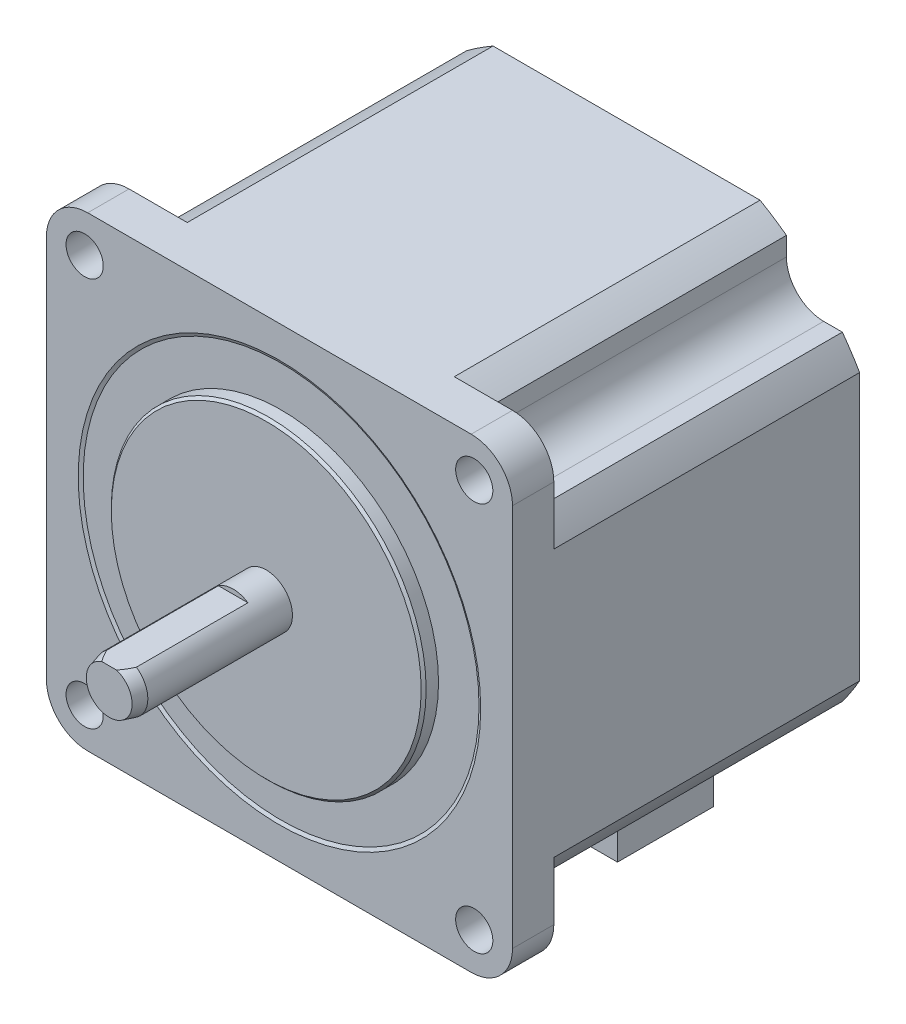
ISO-10303-21;
HEADER;
FILE_DESCRIPTION(('STEP AP214'),'2;1');
FILE_NAME('part.step','',(''),(''),'','','');
FILE_SCHEMA(('AUTOMOTIVE_DESIGN { 1 0 10303 214 1 1 1 1 }'));
ENDSEC;
DATA;
#1=APPLICATION_CONTEXT('core data for automotive mechanical design processes');
#2=APPLICATION_PROTOCOL_DEFINITION('international standard','automotive_design',2000,#1);
#3=PRODUCT_CONTEXT('',#1,'mechanical');
#4=PRODUCT('Part','Part','',(#3));
#5=PRODUCT_RELATED_PRODUCT_CATEGORY('part','',(#4));
#6=PRODUCT_DEFINITION_FORMATION('','',#4);
#7=PRODUCT_DEFINITION_CONTEXT('part definition',#1,'design');
#8=PRODUCT_DEFINITION('design','',#6,#7);
#9=PRODUCT_DEFINITION_SHAPE('','',#8);
#10=(LENGTH_UNIT() NAMED_UNIT(*) SI_UNIT(.MILLI.,.METRE.));
#11=(NAMED_UNIT(*) PLANE_ANGLE_UNIT() SI_UNIT($,.RADIAN.));
#12=(NAMED_UNIT(*) SI_UNIT($,.STERADIAN.) SOLID_ANGLE_UNIT());
#13=UNCERTAINTY_MEASURE_WITH_UNIT(LENGTH_MEASURE(1.E-05),#10,'distance_accuracy_value','');
#14=(GEOMETRIC_REPRESENTATION_CONTEXT(3) GLOBAL_UNCERTAINTY_ASSIGNED_CONTEXT((#13)) GLOBAL_UNIT_ASSIGNED_CONTEXT((#10,
#11,#12)) REPRESENTATION_CONTEXT('',''));
#15=CARTESIAN_POINT('',(0.,0.,0.));
#16=DIRECTION('',(0.,0.,1.));
#17=DIRECTION('',(1.,0.,0.));
#18=AXIS2_PLACEMENT_3D('',#15,#16,#17);
#19=CARTESIAN_POINT('',(0.,0.,19.));
#20=DIRECTION('',(0.,0.,-1.));
#21=DIRECTION('',(-1.,0.,0.));
#22=AXIS2_PLACEMENT_3D('',#19,#20,#21);
#23=CYLINDRICAL_SURFACE('',#22,3.175);
#24=CARTESIAN_POINT('',(0.,0.,17.5));
#25=DIRECTION('',(0.,0.,1.));
#26=DIRECTION('',(1.,0.,0.));
#27=AXIS2_PLACEMENT_3D('',#24,#25,#26);
#28=CIRCLE('',#27,3.175);
#29=CARTESIAN_POINT('',(1.78605710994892,2.625,17.500000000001));
#30=VERTEX_POINT('',#29);
#31=CARTESIAN_POINT('',(-1.78605710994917,2.625,17.5));
#32=VERTEX_POINT('',#31);
#33=EDGE_CURVE('E310',#30,#32,#28,.F.);
#34=ORIENTED_EDGE('',*,*,#33,.T.);
#35=DIRECTION('',(0.,0.,-1.));
#36=VECTOR('',#35,1.);
#37=CARTESIAN_POINT('',(-1.78605710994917,2.625,19.));
#38=LINE('',#37,#36);
#39=CARTESIAN_POINT('',(-1.78605710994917,2.625,4.));
#40=VERTEX_POINT('',#39);
#41=EDGE_CURVE('E294',#32,#40,#38,.T.);
#42=ORIENTED_EDGE('',*,*,#41,.T.);
#43=CARTESIAN_POINT('',(0.,0.,4.));
#44=DIRECTION('',(0.,0.,1.));
#45=DIRECTION('',(1.,0.,0.));
#46=AXIS2_PLACEMENT_3D('',#43,#44,#45);
#47=CIRCLE('',#46,3.175);
#48=CARTESIAN_POINT('',(1.78605710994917,2.625,4.));
#49=VERTEX_POINT('',#48);
#50=EDGE_CURVE('E299',#49,#40,#47,.T.);
#51=ORIENTED_EDGE('',*,*,#50,.F.);
#52=DIRECTION('',(0.,0.,-1.));
#53=VECTOR('',#52,1.);
#54=CARTESIAN_POINT('',(1.78605710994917,2.625,19.));
#55=LINE('',#54,#53);
#56=EDGE_CURVE('E1236',#49,#30,#55,.F.);
#57=ORIENTED_EDGE('',*,*,#56,.T.);
#58=EDGE_LOOP('',(#34,#42,#51,#57));
#59=FACE_BOUND('',#58,.T.);
#60=CARTESIAN_POINT('',(0.,0.,0.));
#61=DIRECTION('',(0.,0.,-1.));
#62=DIRECTION('',(-1.,0.,0.));
#63=AXIS2_PLACEMENT_3D('',#60,#61,#62);
#64=CIRCLE('',#63,3.175);
#65=CARTESIAN_POINT('',(-3.175,0.,0.));
#66=VERTEX_POINT('',#65);
#67=EDGE_CURVE('E755',#66,#66,#64,.T.);
#68=ORIENTED_EDGE('',*,*,#67,.F.);
#69=EDGE_LOOP('',(#68));
#70=FACE_BOUND('',#69,.T.);
#71=ADVANCED_FACE('F39',(#59,#70),#23,.T.);
#72=CARTESIAN_POINT('',(0.,0.,19.));
#73=DIRECTION('',(0.,0.,1.));
#74=DIRECTION('',(1.,0.,0.));
#75=AXIS2_PLACEMENT_3D('',#72,#73,#74);
#76=PLANE('',#75);
#77=DIRECTION('',(1.,0.,0.));
#78=VECTOR('',#77,1.);
#79=CARTESIAN_POINT('',(-4.72781232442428,2.625,19.));
#80=LINE('',#79,#78);
#81=CARTESIAN_POINT('',(-0.89405071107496,2.625,19.));
#82=VERTEX_POINT('',#81);
#83=CARTESIAN_POINT('',(0.89405071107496,2.625,19.));
#84=VERTEX_POINT('',#83);
#85=EDGE_CURVE('E54',#82,#84,#80,.T.);
#86=ORIENTED_EDGE('',*,*,#85,.F.);
#87=CARTESIAN_POINT('',(0.,0.,19.));
#88=DIRECTION('',(0.,0.,1.));
#89=DIRECTION('',(1.,0.,0.));
#90=AXIS2_PLACEMENT_3D('',#87,#88,#89);
#91=CIRCLE('',#90,2.77307621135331);
#92=EDGE_CURVE('E305',#82,#84,#91,.T.);
#93=ORIENTED_EDGE('',*,*,#92,.T.);
#94=EDGE_LOOP('',(#86,#93));
#95=FACE_BOUND('',#94,.T.);
#96=ADVANCED_FACE('F304',(#95),#76,.T.);
#97=CARTESIAN_POINT('',(0.,0.,0.));
#98=DIRECTION('',(0.,0.,-1.));
#99=DIRECTION('',(-1.,0.,0.));
#100=AXIS2_PLACEMENT_3D('',#97,#98,#99);
#101=PLANE('',#100);
#102=CARTESIAN_POINT('',(0.,0.,0.));
#103=DIRECTION('',(0.,0.,-1.));
#104=DIRECTION('',(-1.,0.,0.));
#105=AXIS2_PLACEMENT_3D('',#102,#103,#104);
#106=CIRCLE('',#105,18.75);
#107=CARTESIAN_POINT('',(-18.75,0.,0.));
#108=VERTEX_POINT('',#107);
#109=EDGE_CURVE('E11',#108,#108,#106,.F.);
#110=ORIENTED_EDGE('',*,*,#109,.T.);
#111=EDGE_LOOP('',(#110));
#112=FACE_BOUND('',#111,.T.);
#113=ORIENTED_EDGE('',*,*,#67,.T.);
#114=EDGE_LOOP('',(#113));
#115=FACE_BOUND('',#114,.T.);
#116=ADVANCED_FACE('F445',(#112,#115),#101,.F.);
#117=CARTESIAN_POINT('',(0.,0.,-1.6));
#118=DIRECTION('',(0.,0.,1.));
#119=DIRECTION('',(1.,0.,0.));
#120=AXIS2_PLACEMENT_3D('',#117,#118,#119);
#121=CYLINDRICAL_SURFACE('',#120,19.05);
#122=CARTESIAN_POINT('',(0.,0.,-0.299999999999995));
#123=DIRECTION('',(0.,0.,-1.));
#124=DIRECTION('',(-1.,0.,0.));
#125=AXIS2_PLACEMENT_3D('',#122,#123,#124);
#126=CIRCLE('',#125,19.05);
#127=CARTESIAN_POINT('',(-19.05,0.,-0.299999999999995));
#128=VERTEX_POINT('',#127);
#129=EDGE_CURVE('E47',#128,#128,#126,.T.);
#130=ORIENTED_EDGE('',*,*,#129,.T.);
#131=EDGE_LOOP('',(#130));
#132=FACE_BOUND('',#131,.T.);
#133=CARTESIAN_POINT('',(0.,0.,-1.8));
#134=DIRECTION('',(0.,0.,1.));
#135=DIRECTION('',(1.,0.,0.));
#136=AXIS2_PLACEMENT_3D('',#133,#134,#135);
#137=CIRCLE('',#136,19.05);
#138=CARTESIAN_POINT('',(19.05,0.,-1.8));
#139=VERTEX_POINT('',#138);
#140=EDGE_CURVE('E1269',#139,#139,#137,.T.);
#141=ORIENTED_EDGE('',*,*,#140,.T.);
#142=EDGE_LOOP('',(#141));
#143=FACE_BOUND('',#142,.T.);
#144=ADVANCED_FACE('F448',(#132,#143),#121,.T.);
#145=CARTESIAN_POINT('',(0.,0.,19.));
#146=DIRECTION('',(0.,0.,-1.));
#147=DIRECTION('',(-1.,0.,0.));
#148=AXIS2_PLACEMENT_3D('',#145,#146,#147);
#149=CONICAL_SURFACE('',#148,2.77307621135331,0.261799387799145);
#150=CARTESIAN_POINT('',(-3.30935894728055,2.625,13.5849436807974));
#151=CARTESIAN_POINT('',(-3.24542473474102,2.625,13.7718399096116));
#152=CARTESIAN_POINT('',(-3.180873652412,2.625,13.9585279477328));
#153=CARTESIAN_POINT('',(-3.05023975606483,2.625,14.3313889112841));
#154=CARTESIAN_POINT('',(-2.98415678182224,2.625,14.5175617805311));
#155=CARTESIAN_POINT('',(-2.85014549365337,2.625,14.8893346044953));
#156=CARTESIAN_POINT('',(-2.78221639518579,2.625,15.0749342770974));
#157=CARTESIAN_POINT('',(-2.64413585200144,2.625,15.445295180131));
#158=CARTESIAN_POINT('',(-2.57398453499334,2.625,15.630056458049));
#159=CARTESIAN_POINT('',(-2.43088450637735,2.625,15.9985625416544));
#160=CARTESIAN_POINT('',(-2.35793492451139,2.625,16.1823070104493));
#161=CARTESIAN_POINT('',(-2.20847433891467,2.625,16.5483836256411));
#162=CARTESIAN_POINT('',(-2.13196278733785,2.625,16.730715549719));
#163=CARTESIAN_POINT('',(-1.97412292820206,2.625,17.0936282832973));
#164=CARTESIAN_POINT('',(-1.89278731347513,2.625,17.2742059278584));
#165=CARTESIAN_POINT('',(-1.72367545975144,2.625,17.6322943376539));
#166=CARTESIAN_POINT('',(-1.63590163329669,2.625,17.8098062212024));
#167=CARTESIAN_POINT('',(-1.49689402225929,2.625,18.0727010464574));
#168=CARTESIAN_POINT('',(-1.44921905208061,2.625,18.159961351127));
#169=CARTESIAN_POINT('',(-1.3508144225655,2.625,18.3328001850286));
#170=CARTESIAN_POINT('',(-1.30008362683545,2.625,18.4183780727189));
#171=CARTESIAN_POINT('',(-1.19492866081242,2.625,18.5868191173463));
#172=CARTESIAN_POINT('',(-1.14051856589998,2.625,18.6696910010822));
#173=CARTESIAN_POINT('',(-1.02665023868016,2.625,18.8318604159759));
#174=CARTESIAN_POINT('',(-0.967196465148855,2.625,18.9111610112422));
#175=CARTESIAN_POINT('',(-0.862242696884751,2.625,19.0387203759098));
#176=CARTESIAN_POINT('',(-0.818661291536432,2.625,19.0885458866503));
#177=CARTESIAN_POINT('',(-0.727513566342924,2.625,19.1846578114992));
#178=CARTESIAN_POINT('',(-0.679939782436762,2.625,19.2309372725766));
#179=CARTESIAN_POINT('',(-0.579402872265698,2.625,19.3185048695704));
#180=CARTESIAN_POINT('',(-0.526387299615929,2.625,19.3597339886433));
#181=CARTESIAN_POINT('',(-0.414507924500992,2.625,19.4333493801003));
#182=CARTESIAN_POINT('',(-0.355665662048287,2.625,19.4657666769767));
#183=CARTESIAN_POINT('',(-0.254920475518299,2.625,19.5076037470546));
#184=CARTESIAN_POINT('',(-0.214733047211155,2.625,19.5210971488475));
#185=CARTESIAN_POINT('',(-0.132696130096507,2.625,19.5413023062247));
#186=CARTESIAN_POINT('',(-0.0908493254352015,2.625,19.5480245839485));
#187=CARTESIAN_POINT('',(-0.00641419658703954,2.625,19.5538691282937));
#188=CARTESIAN_POINT('',(0.0361766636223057,2.625,19.5529560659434));
#189=CARTESIAN_POINT('',(0.120530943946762,2.625,19.5435732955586));
#190=CARTESIAN_POINT('',(0.162293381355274,2.625,19.5350951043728));
#191=CARTESIAN_POINT('',(0.254092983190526,2.625,19.5086701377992));
#192=CARTESIAN_POINT('',(0.303590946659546,2.625,19.4888870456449));
#193=CARTESIAN_POINT('',(0.398827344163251,2.625,19.4417789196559));
#194=CARTESIAN_POINT('',(0.444557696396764,2.625,19.4144381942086));
#195=CARTESIAN_POINT('',(0.528152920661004,2.625,19.3573624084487));
#196=CARTESIAN_POINT('',(0.566351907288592,2.625,19.3281050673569));
#197=CARTESIAN_POINT('',(0.640136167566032,2.625,19.2664333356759));
#198=CARTESIAN_POINT('',(0.675718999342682,2.625,19.23401605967));
#199=CARTESIAN_POINT('',(0.74472099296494,2.625,19.1667643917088));
#200=CARTESIAN_POINT('',(0.77813283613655,2.625,19.1319225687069));
#201=CARTESIAN_POINT('',(0.842993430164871,2.625,19.0605004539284));
#202=CARTESIAN_POINT('',(0.874443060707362,2.625,19.0239209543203));
#203=CARTESIAN_POINT('',(0.960526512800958,2.625,18.9192141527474));
#204=CARTESIAN_POINT('',(1.01328788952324,2.625,18.8495504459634));
#205=CARTESIAN_POINT('',(1.11474355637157,2.625,18.7073019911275));
#206=CARTESIAN_POINT('',(1.16343498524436,2.625,18.6347152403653));
#207=CARTESIAN_POINT('',(1.25772470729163,2.625,18.4873519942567));
#208=CARTESIAN_POINT('',(1.30331615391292,2.625,18.4125711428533));
#209=CARTESIAN_POINT('',(1.39194135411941,2.625,18.2615031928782));
#210=CARTESIAN_POINT('',(1.43497467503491,2.625,18.1852158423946));
#211=CARTESIAN_POINT('',(1.56162993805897,2.625,17.9534626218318));
#212=CARTESIAN_POINT('',(1.64208680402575,2.625,17.7962698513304));
#213=CARTESIAN_POINT('',(1.79705705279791,2.625,17.4792970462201));
#214=CARTESIAN_POINT('',(1.87157841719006,2.625,17.3195208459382));
#215=CARTESIAN_POINT('',(2.0105464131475,2.625,17.0108615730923));
#216=CARTESIAN_POINT('',(2.07532251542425,2.625,16.8621261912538));
#217=CARTESIAN_POINT('',(2.20202359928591,2.625,16.5634427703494));
#218=CARTESIAN_POINT('',(2.26394842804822,2.625,16.4134946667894));
#219=CARTESIAN_POINT('',(2.44641955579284,2.625,15.962047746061));
#220=CARTESIAN_POINT('',(2.56356197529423,2.625,15.6591749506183));
#221=CARTESIAN_POINT('',(2.78774888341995,2.625,15.0616544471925));
#222=CARTESIAN_POINT('',(2.89500244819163,2.625,14.767084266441));
#223=CARTESIAN_POINT('',(3.0526461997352,2.625,14.3242983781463));
#224=CARTESIAN_POINT('',(3.10462177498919,2.625,14.1766447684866));
#225=CARTESIAN_POINT('',(3.20764960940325,2.625,13.881020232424));
#226=CARTESIAN_POINT('',(3.25870189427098,2.625,13.7330493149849));
#227=CARTESIAN_POINT('',(3.30935894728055,2.625,13.5849436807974));
#228=B_SPLINE_CURVE_WITH_KNOTS('',3,(#150,#151,#152,#153,#154,#155,#156,#157,#158,#159,#160,
#161,#162,#163,#164,#165,#166,#167,#168,#169,#170,#171,#172,#173,#174,#175,#176,#177,#178,#179,
#180,#181,#182,#183,#184,#185,#186,#187,#188,#189,#190,#191,#192,#193,#194,#195,#196,#197,#198,
#199,#200,#201,#202,#203,#204,#205,#206,#207,#208,#209,#210,#211,#212,#213,#214,#215,#216,#217,
#218,#219,#220,#221,#222,#223,#224,#225,#226,#227),.UNSPECIFIED.,.F.,.F.,(4,2,2,2,2,2,2,2,2,2,2,
2,2,2,2,2,2,2,2,2,2,2,2,2,2,2,2,2,2,2,2,2,2,2,2,2,2,2,4),(0.,0.592590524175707,1.18524331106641,
1.77815202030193,2.37102671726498,2.96408731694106,3.55723943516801,4.15131417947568,
4.74516743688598,5.04342777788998,5.34179972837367,5.63908859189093,5.93611732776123,
6.1345556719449,6.33337364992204,6.53432931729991,6.73456801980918,6.86126706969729,
6.9877689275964,7.11485643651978,7.24208663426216,7.40110146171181,7.56044895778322,
7.70458491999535,7.84885375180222,7.99358608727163,8.13825306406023,8.40019160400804,
8.66231276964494,8.92499521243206,9.18772195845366,9.71727649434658,10.2461064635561,
10.732753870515,11.2194273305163,12.1935231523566,13.1339513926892,13.6035521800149,
14.0731398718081),.UNSPECIFIED.);
#229=EDGE_CURVE('E290',#32,#82,#228,.T.);
#230=ORIENTED_EDGE('',*,*,#229,.F.);
#231=ORIENTED_EDGE('',*,*,#33,.F.);
#232=EDGE_CURVE('E300',#84,#30,#228,.T.);
#233=ORIENTED_EDGE('',*,*,#232,.F.);
#234=ORIENTED_EDGE('',*,*,#92,.F.);
#235=EDGE_LOOP('',(#230,#231,#233,#234));
#236=FACE_BOUND('',#235,.T.);
#237=ADVANCED_FACE('F309',(#236),#149,.T.);
#238=CARTESIAN_POINT('',(0.,0.,4.));
#239=DIRECTION('',(0.,0.,1.));
#240=DIRECTION('',(1.,0.,0.));
#241=AXIS2_PLACEMENT_3D('',#238,#239,#240);
#242=PLANE('',#241);
#243=ORIENTED_EDGE('',*,*,#50,.T.);
#244=DIRECTION('',(1.,0.,0.));
#245=VECTOR('',#244,1.);
#246=CARTESIAN_POINT('',(-4.72781232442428,2.625,4.));
#247=LINE('',#246,#245);
#248=EDGE_CURVE('E306',#40,#49,#247,.T.);
#249=ORIENTED_EDGE('',*,*,#248,.T.);
#250=EDGE_LOOP('',(#243,#249));
#251=FACE_BOUND('',#250,.T.);
#252=ADVANCED_FACE('F331',(#251),#242,.T.);
#253=CARTESIAN_POINT('',(-4.72781232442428,2.625,4.));
#254=DIRECTION('',(0.,-1.,0.));
#255=DIRECTION('',(0.,0.,-1.));
#256=AXIS2_PLACEMENT_3D('',#253,#254,#255);
#257=PLANE('',#256);
#258=ORIENTED_EDGE('',*,*,#229,.T.);
#259=ORIENTED_EDGE('',*,*,#85,.T.);
#260=ORIENTED_EDGE('',*,*,#232,.T.);
#261=ORIENTED_EDGE('',*,*,#56,.F.);
#262=ORIENTED_EDGE('',*,*,#248,.F.);
#263=ORIENTED_EDGE('',*,*,#41,.F.);
#264=EDGE_LOOP('',(#258,#259,#260,#261,#262,#263));
#265=FACE_BOUND('',#264,.T.);
#266=ADVANCED_FACE('F291',(#265),#257,.F.);
#267=CARTESIAN_POINT('',(0.,0.,-1.8));
#268=DIRECTION('',(0.,0.,1.));
#269=DIRECTION('',(1.,0.,0.));
#270=AXIS2_PLACEMENT_3D('',#267,#268,#269);
#271=PLANE('',#270);
#272=CARTESIAN_POINT('',(0.,0.,-1.8));
#273=DIRECTION('',(0.,0.,1.));
#274=DIRECTION('',(1.,0.,0.));
#275=AXIS2_PLACEMENT_3D('',#272,#273,#274);
#276=CIRCLE('',#275,23.95);
#277=CARTESIAN_POINT('',(23.95,0.,-1.8));
#278=VERTEX_POINT('',#277);
#279=EDGE_CURVE('E1230',#278,#278,#276,.T.);
#280=ORIENTED_EDGE('',*,*,#279,.T.);
#281=EDGE_LOOP('',(#280));
#282=FACE_BOUND('',#281,.T.);
#283=ORIENTED_EDGE('',*,*,#140,.F.);
#284=EDGE_LOOP('',(#283));
#285=FACE_BOUND('',#284,.T.);
#286=ADVANCED_FACE('F330',(#282,#285),#271,.T.);
#287=CARTESIAN_POINT('',(0.,-19.35,-43.6));
#288=DIRECTION('',(0.,1.,0.));
#289=DIRECTION('',(-1.,0.,0.));
#290=AXIS2_PLACEMENT_3D('',#287,#288,#289);
#291=PLANE('',#290);
#292=DIRECTION('',(-1.,0.,0.));
#293=VECTOR('',#292,1.);
#294=CARTESIAN_POINT('',(0.,-19.35,-43.6));
#295=LINE('',#294,#293);
#296=CARTESIAN_POINT('',(-23.85,-19.35,-43.6));
#297=VERTEX_POINT('',#296);
#298=CARTESIAN_POINT('',(-26.1118268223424,-19.35,-43.6));
#299=VERTEX_POINT('',#298);
#300=EDGE_CURVE('E523',#297,#299,#295,.T.);
#301=ORIENTED_EDGE('',*,*,#300,.F.);
#302=DIRECTION('',(0.,0.,1.));
#303=VECTOR('',#302,1.);
#304=CARTESIAN_POINT('',(-23.85,-19.35,-43.6));
#305=LINE('',#304,#303);
#306=CARTESIAN_POINT('',(-23.85,-19.35,-6.6));
#307=VERTEX_POINT('',#306);
#308=EDGE_CURVE('E592',#297,#307,#305,.T.);
#309=ORIENTED_EDGE('',*,*,#308,.T.);
#310=DIRECTION('',(-1.,0.,0.));
#311=VECTOR('',#310,1.);
#312=CARTESIAN_POINT('',(0.,-19.35,-6.6));
#313=LINE('',#312,#311);
#314=CARTESIAN_POINT('',(-26.1118268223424,-19.35,-6.6));
#315=VERTEX_POINT('',#314);
#316=EDGE_CURVE('E675',#307,#315,#313,.T.);
#317=ORIENTED_EDGE('',*,*,#316,.T.);
#318=DIRECTION('',(0.,0.,1.));
#319=VECTOR('',#318,1.);
#320=CARTESIAN_POINT('',(-26.1118268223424,-19.35,-43.6));
#321=LINE('',#320,#319);
#322=EDGE_CURVE('E677',#299,#315,#321,.T.);
#323=ORIENTED_EDGE('',*,*,#322,.F.);
#324=EDGE_LOOP('',(#301,#309,#317,#323));
#325=FACE_BOUND('',#324,.T.);
#326=ADVANCED_FACE('F363',(#325),#291,.F.);
#327=CARTESIAN_POINT('',(-23.85,-23.85,-43.6));
#328=DIRECTION('',(0.,0.,1.));
#329=DIRECTION('',(1.,0.,0.));
#330=AXIS2_PLACEMENT_3D('',#327,#328,#329);
#331=CYLINDRICAL_SURFACE('',#330,4.5);
#332=CARTESIAN_POINT('',(-23.85,-23.85,-43.6));
#333=DIRECTION('',(0.,0.,-1.));
#334=DIRECTION('',(-1.,0.,0.));
#335=AXIS2_PLACEMENT_3D('',#332,#333,#334);
#336=CIRCLE('',#335,4.5);
#337=CARTESIAN_POINT('',(-19.35,-23.85,-43.6));
#338=VERTEX_POINT('',#337);
#339=EDGE_CURVE('E612',#338,#297,#336,.F.);
#340=ORIENTED_EDGE('',*,*,#339,.F.);
#341=DIRECTION('',(0.,0.,1.));
#342=VECTOR('',#341,1.);
#343=CARTESIAN_POINT('',(-19.35,-23.85,-43.6));
#344=LINE('',#343,#342);
#345=CARTESIAN_POINT('',(-19.35,-23.85,-6.6));
#346=VERTEX_POINT('',#345);
#347=EDGE_CURVE('E597',#346,#338,#344,.F.);
#348=ORIENTED_EDGE('',*,*,#347,.F.);
#349=CARTESIAN_POINT('',(-23.85,-23.85,-6.6));
#350=DIRECTION('',(0.,0.,-1.));
#351=DIRECTION('',(-1.,0.,0.));
#352=AXIS2_PLACEMENT_3D('',#349,#350,#351);
#353=CIRCLE('',#352,4.5);
#354=EDGE_CURVE('E595',#307,#346,#353,.T.);
#355=ORIENTED_EDGE('',*,*,#354,.F.);
#356=ORIENTED_EDGE('',*,*,#308,.F.);
#357=EDGE_LOOP('',(#340,#348,#355,#356));
#358=FACE_BOUND('',#357,.T.);
#359=ADVANCED_FACE('F366',(#358),#331,.F.);
#360=CARTESIAN_POINT('',(-19.35,0.,-43.6));
#361=DIRECTION('',(-1.,0.,0.));
#362=DIRECTION('',(0.,-1.,0.));
#363=AXIS2_PLACEMENT_3D('',#360,#361,#362);
#364=PLANE('',#363);
#365=DIRECTION('',(0.,-1.,0.));
#366=VECTOR('',#365,1.);
#367=CARTESIAN_POINT('',(-19.35,0.,-6.6));
#368=LINE('',#367,#366);
#369=CARTESIAN_POINT('',(-19.35,-26.1118268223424,-6.6));
#370=VERTEX_POINT('',#369);
#371=EDGE_CURVE('E673',#346,#370,#368,.T.);
#372=ORIENTED_EDGE('',*,*,#371,.F.);
#373=ORIENTED_EDGE('',*,*,#347,.T.);
#374=DIRECTION('',(0.,-1.,0.));
#375=VECTOR('',#374,1.);
#376=CARTESIAN_POINT('',(-19.35,0.,-43.6));
#377=LINE('',#376,#375);
#378=CARTESIAN_POINT('',(-19.35,-26.1118268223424,-43.6));
#379=VERTEX_POINT('',#378);
#380=EDGE_CURVE('E521',#338,#379,#377,.T.);
#381=ORIENTED_EDGE('',*,*,#380,.T.);
#382=DIRECTION('',(0.,0.,1.));
#383=VECTOR('',#382,1.);
#384=CARTESIAN_POINT('',(-19.35,-26.1118268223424,-43.6));
#385=LINE('',#384,#383);
#386=EDGE_CURVE('E680',#379,#370,#385,.T.);
#387=ORIENTED_EDGE('',*,*,#386,.T.);
#388=EDGE_LOOP('',(#372,#373,#381,#387));
#389=FACE_BOUND('',#388,.T.);
#390=ADVANCED_FACE('F368',(#389),#364,.T.);
#391=CARTESIAN_POINT('',(-19.35,0.,-43.6));
#392=DIRECTION('',(-1.,0.,0.));
#393=DIRECTION('',(0.,0.,1.));
#394=AXIS2_PLACEMENT_3D('',#391,#392,#393);
#395=PLANE('',#394);
#396=DIRECTION('',(0.,-1.,0.));
#397=VECTOR('',#396,1.);
#398=CARTESIAN_POINT('',(-19.35,0.,-43.6));
#399=LINE('',#398,#397);
#400=CARTESIAN_POINT('',(-19.35,26.1118268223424,-43.6));
#401=VERTEX_POINT('',#400);
#402=CARTESIAN_POINT('',(-19.35,23.85,-43.6));
#403=VERTEX_POINT('',#402);
#404=EDGE_CURVE('E617',#401,#403,#399,.T.);
#405=ORIENTED_EDGE('',*,*,#404,.T.);
#406=DIRECTION('',(0.,0.,1.));
#407=VECTOR('',#406,1.);
#408=CARTESIAN_POINT('',(-19.35,23.85,-6.6));
#409=LINE('',#408,#407);
#410=CARTESIAN_POINT('',(-19.35,23.85,-6.6));
#411=VERTEX_POINT('',#410);
#412=EDGE_CURVE('E599',#403,#411,#409,.T.);
#413=ORIENTED_EDGE('',*,*,#412,.T.);
#414=DIRECTION('',(0.,-1.,0.));
#415=VECTOR('',#414,1.);
#416=CARTESIAN_POINT('',(-19.35,0.,-6.6));
#417=LINE('',#416,#415);
#418=CARTESIAN_POINT('',(-19.35,26.1118268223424,-6.6));
#419=VERTEX_POINT('',#418);
#420=EDGE_CURVE('E578',#419,#411,#417,.T.);
#421=ORIENTED_EDGE('',*,*,#420,.F.);
#422=DIRECTION('',(0.,0.,1.));
#423=VECTOR('',#422,1.);
#424=CARTESIAN_POINT('',(-19.35,26.1118268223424,-43.6));
#425=LINE('',#424,#423);
#426=EDGE_CURVE('E581',#401,#419,#425,.T.);
#427=ORIENTED_EDGE('',*,*,#426,.F.);
#428=EDGE_LOOP('',(#405,#413,#421,#427));
#429=FACE_BOUND('',#428,.T.);
#430=ADVANCED_FACE('F371',(#429),#395,.T.);
#431=CARTESIAN_POINT('',(-23.85,23.85,-43.6));
#432=DIRECTION('',(0.,0.,-1.));
#433=DIRECTION('',(-1.,0.,0.));
#434=AXIS2_PLACEMENT_3D('',#431,#432,#433);
#435=CYLINDRICAL_SURFACE('',#434,4.5);
#436=CARTESIAN_POINT('',(-23.85,23.85,-43.6));
#437=DIRECTION('',(0.,0.,-1.));
#438=DIRECTION('',(-1.,0.,0.));
#439=AXIS2_PLACEMENT_3D('',#436,#437,#438);
#440=CIRCLE('',#439,4.5);
#441=CARTESIAN_POINT('',(-23.85,19.35,-43.6));
#442=VERTEX_POINT('',#441);
#443=EDGE_CURVE('E314',#442,#403,#440,.F.);
#444=ORIENTED_EDGE('',*,*,#443,.F.);
#445=DIRECTION('',(0.,0.,1.));
#446=VECTOR('',#445,1.);
#447=CARTESIAN_POINT('',(-23.85,19.35,-43.6));
#448=LINE('',#447,#446);
#449=CARTESIAN_POINT('',(-23.85,19.35,-6.6));
#450=VERTEX_POINT('',#449);
#451=EDGE_CURVE('E604',#450,#442,#448,.F.);
#452=ORIENTED_EDGE('',*,*,#451,.F.);
#453=CARTESIAN_POINT('',(-23.85,23.85,-6.6));
#454=DIRECTION('',(0.,0.,-1.));
#455=DIRECTION('',(-1.,0.,0.));
#456=AXIS2_PLACEMENT_3D('',#453,#454,#455);
#457=CIRCLE('',#456,4.5);
#458=EDGE_CURVE('E602',#411,#450,#457,.T.);
#459=ORIENTED_EDGE('',*,*,#458,.F.);
#460=ORIENTED_EDGE('',*,*,#412,.F.);
#461=EDGE_LOOP('',(#444,#452,#459,#460));
#462=FACE_BOUND('',#461,.T.);
#463=ADVANCED_FACE('F391',(#462),#435,.F.);
#464=CARTESIAN_POINT('',(0.,19.3500000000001,-43.6));
#465=DIRECTION('',(0.,1.,0.));
#466=DIRECTION('',(-1.,0.,0.));
#467=AXIS2_PLACEMENT_3D('',#464,#465,#466);
#468=PLANE('',#467);
#469=DIRECTION('',(-1.,0.,0.));
#470=VECTOR('',#469,1.);
#471=CARTESIAN_POINT('',(0.,19.3500000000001,-6.6));
#472=LINE('',#471,#470);
#473=CARTESIAN_POINT('',(-26.1118268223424,19.35,-6.6));
#474=VERTEX_POINT('',#473);
#475=EDGE_CURVE('E528',#450,#474,#472,.T.);
#476=ORIENTED_EDGE('',*,*,#475,.F.);
#477=ORIENTED_EDGE('',*,*,#451,.T.);
#478=DIRECTION('',(-1.,0.,0.));
#479=VECTOR('',#478,1.);
#480=CARTESIAN_POINT('',(0.,19.3500000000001,-43.6));
#481=LINE('',#480,#479);
#482=CARTESIAN_POINT('',(-26.1118268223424,19.35,-43.6));
#483=VERTEX_POINT('',#482);
#484=EDGE_CURVE('E619',#442,#483,#481,.T.);
#485=ORIENTED_EDGE('',*,*,#484,.T.);
#486=DIRECTION('',(0.,0.,1.));
#487=VECTOR('',#486,1.);
#488=CARTESIAN_POINT('',(-26.1118268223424,19.35,-43.6));
#489=LINE('',#488,#487);
#490=EDGE_CURVE('E632',#483,#474,#489,.T.);
#491=ORIENTED_EDGE('',*,*,#490,.T.);
#492=EDGE_LOOP('',(#476,#477,#485,#491));
#493=FACE_BOUND('',#492,.T.);
#494=ADVANCED_FACE('F337',(#493),#468,.T.);
#495=CARTESIAN_POINT('',(0.,-38.2,0.));
#496=DIRECTION('',(0.,1.,0.));
#497=DIRECTION('',(0.,0.,1.));
#498=AXIS2_PLACEMENT_3D('',#495,#496,#497);
#499=PLANE('',#498);
#500=DIRECTION('',(0.,0.,-1.));
#501=VECTOR('',#500,1.);
#502=CARTESIAN_POINT('',(-10.5,-38.2,-43.6));
#503=LINE('',#502,#501);
#504=CARTESIAN_POINT('',(-10.5,-38.2,-32.));
#505=VERTEX_POINT('',#504);
#506=CARTESIAN_POINT('',(-10.5,-38.2,-43.6));
#507=VERTEX_POINT('',#506);
#508=EDGE_CURVE('E1244',#505,#507,#503,.T.);
#509=ORIENTED_EDGE('',*,*,#508,.T.);
#510=DIRECTION('',(1.,0.,0.));
#511=VECTOR('',#510,1.);
#512=CARTESIAN_POINT('',(-10.5,-38.2,-43.6));
#513=LINE('',#512,#511);
#514=CARTESIAN_POINT('',(10.5,-38.2,-43.6));
#515=VERTEX_POINT('',#514);
#516=EDGE_CURVE('E1247',#507,#515,#513,.T.);
#517=ORIENTED_EDGE('',*,*,#516,.T.);
#518=DIRECTION('',(0.,0.,1.));
#519=VECTOR('',#518,1.);
#520=CARTESIAN_POINT('',(10.5,-38.2,-43.6));
#521=LINE('',#520,#519);
#522=CARTESIAN_POINT('',(10.5,-38.2,-32.));
#523=VERTEX_POINT('',#522);
#524=EDGE_CURVE('E1250',#515,#523,#521,.T.);
#525=ORIENTED_EDGE('',*,*,#524,.T.);
#526=DIRECTION('',(-1.,0.,0.));
#527=VECTOR('',#526,1.);
#528=CARTESIAN_POINT('',(-10.5,-38.2,-32.));
#529=LINE('',#528,#527);
#530=EDGE_CURVE('E1252',#523,#505,#529,.T.);
#531=ORIENTED_EDGE('',*,*,#530,.T.);
#532=EDGE_LOOP('',(#509,#517,#525,#531));
#533=FACE_BOUND('',#532,.T.);
#534=ADVANCED_FACE('F333',(#533),#499,.F.);
#535=CARTESIAN_POINT('',(19.35,0.,-43.6));
#536=DIRECTION('',(-1.,0.,0.));
#537=DIRECTION('',(0.,-1.,0.));
#538=AXIS2_PLACEMENT_3D('',#535,#536,#537);
#539=PLANE('',#538);
#540=DIRECTION('',(0.,-1.,0.));
#541=VECTOR('',#540,1.);
#542=CARTESIAN_POINT('',(19.35,0.,-6.6));
#543=LINE('',#542,#541);
#544=CARTESIAN_POINT('',(19.35,26.1118268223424,-6.6));
#545=VERTEX_POINT('',#544);
#546=CARTESIAN_POINT('',(19.35,23.85,-6.6));
#547=VERTEX_POINT('',#546);
#548=EDGE_CURVE('E567',#545,#547,#543,.T.);
#549=ORIENTED_EDGE('',*,*,#548,.T.);
#550=DIRECTION('',(0.,0.,1.));
#551=VECTOR('',#550,1.);
#552=CARTESIAN_POINT('',(19.35,23.85,-43.6));
#553=LINE('',#552,#551);
#554=CARTESIAN_POINT('',(19.35,23.85,-43.6));
#555=VERTEX_POINT('',#554);
#556=EDGE_CURVE('E485',#547,#555,#553,.F.);
#557=ORIENTED_EDGE('',*,*,#556,.T.);
#558=DIRECTION('',(0.,-1.,0.));
#559=VECTOR('',#558,1.);
#560=CARTESIAN_POINT('',(19.35,0.,-43.6));
#561=LINE('',#560,#559);
#562=CARTESIAN_POINT('',(19.35,26.1118268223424,-43.6));
#563=VERTEX_POINT('',#562);
#564=EDGE_CURVE('E494',#563,#555,#561,.T.);
#565=ORIENTED_EDGE('',*,*,#564,.F.);
#566=DIRECTION('',(0.,0.,1.));
#567=VECTOR('',#566,1.);
#568=CARTESIAN_POINT('',(19.35,26.1118268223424,-43.6));
#569=LINE('',#568,#567);
#570=EDGE_CURVE('E574',#563,#545,#569,.T.);
#571=ORIENTED_EDGE('',*,*,#570,.T.);
#572=EDGE_LOOP('',(#549,#557,#565,#571));
#573=FACE_BOUND('',#572,.T.);
#574=ADVANCED_FACE('F336',(#573),#539,.F.);
#575=CARTESIAN_POINT('',(23.85,23.85,-43.6));
#576=DIRECTION('',(0.,0.,1.));
#577=DIRECTION('',(1.,0.,0.));
#578=AXIS2_PLACEMENT_3D('',#575,#576,#577);
#579=CYLINDRICAL_SURFACE('',#578,4.5);
#580=CARTESIAN_POINT('',(23.85,23.85,-43.6));
#581=DIRECTION('',(0.,0.,-1.));
#582=DIRECTION('',(-1.,0.,0.));
#583=AXIS2_PLACEMENT_3D('',#580,#581,#582);
#584=CIRCLE('',#583,4.5);
#585=CARTESIAN_POINT('',(23.85,19.35,-43.6));
#586=VERTEX_POINT('',#585);
#587=EDGE_CURVE('E311',#555,#586,#584,.F.);
#588=ORIENTED_EDGE('',*,*,#587,.F.);
#589=ORIENTED_EDGE('',*,*,#556,.F.);
#590=CARTESIAN_POINT('',(23.85,23.85,-6.6));
#591=DIRECTION('',(0.,0.,-1.));
#592=DIRECTION('',(-1.,0.,0.));
#593=AXIS2_PLACEMENT_3D('',#590,#591,#592);
#594=CIRCLE('',#593,4.5);
#595=CARTESIAN_POINT('',(23.85,19.35,-6.6));
#596=VERTEX_POINT('',#595);
#597=EDGE_CURVE('E607',#596,#547,#594,.T.);
#598=ORIENTED_EDGE('',*,*,#597,.F.);
#599=DIRECTION('',(0.,0.,1.));
#600=VECTOR('',#599,1.);
#601=CARTESIAN_POINT('',(23.85,19.35,-43.6));
#602=LINE('',#601,#600);
#603=EDGE_CURVE('E487',#586,#596,#602,.T.);
#604=ORIENTED_EDGE('',*,*,#603,.F.);
#605=EDGE_LOOP('',(#588,#589,#598,#604));
#606=FACE_BOUND('',#605,.T.);
#607=ADVANCED_FACE('F384',(#606),#579,.F.);
#608=CARTESIAN_POINT('',(0.,19.3500000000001,-43.6));
#609=DIRECTION('',(0.,1.,0.));
#610=DIRECTION('',(-1.,0.,0.));
#611=AXIS2_PLACEMENT_3D('',#608,#609,#610);
#612=PLANE('',#611);
#613=DIRECTION('',(-1.,0.,0.));
#614=VECTOR('',#613,1.);
#615=CARTESIAN_POINT('',(0.,19.3500000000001,-43.6));
#616=LINE('',#615,#614);
#617=CARTESIAN_POINT('',(26.1118268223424,19.35,-43.6));
#618=VERTEX_POINT('',#617);
#619=EDGE_CURVE('E492',#618,#586,#616,.T.);
#620=ORIENTED_EDGE('',*,*,#619,.T.);
#621=ORIENTED_EDGE('',*,*,#603,.T.);
#622=DIRECTION('',(-1.,0.,0.));
#623=VECTOR('',#622,1.);
#624=CARTESIAN_POINT('',(0.,19.3500000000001,-6.6));
#625=LINE('',#624,#623);
#626=CARTESIAN_POINT('',(26.1118268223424,19.35,-6.6));
#627=VERTEX_POINT('',#626);
#628=EDGE_CURVE('E664',#627,#596,#625,.T.);
#629=ORIENTED_EDGE('',*,*,#628,.F.);
#630=DIRECTION('',(0.,0.,1.));
#631=VECTOR('',#630,1.);
#632=CARTESIAN_POINT('',(26.1118268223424,19.35,-43.6));
#633=LINE('',#632,#631);
#634=EDGE_CURVE('E498',#618,#627,#633,.T.);
#635=ORIENTED_EDGE('',*,*,#634,.F.);
#636=EDGE_LOOP('',(#620,#621,#629,#635));
#637=FACE_BOUND('',#636,.T.);
#638=ADVANCED_FACE('F380',(#637),#612,.T.);
#639=CARTESIAN_POINT('',(0.,-19.3499999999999,-43.6));
#640=DIRECTION('',(0.,1.,0.));
#641=DIRECTION('',(-1.,0.,0.));
#642=AXIS2_PLACEMENT_3D('',#639,#640,#641);
#643=PLANE('',#642);
#644=DIRECTION('',(-1.,0.,0.));
#645=VECTOR('',#644,1.);
#646=CARTESIAN_POINT('',(0.,-19.3499999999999,-6.6));
#647=LINE('',#646,#645);
#648=CARTESIAN_POINT('',(26.1118268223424,-19.35,-6.6));
#649=VERTEX_POINT('',#648);
#650=CARTESIAN_POINT('',(23.85,-19.35,-6.6));
#651=VERTEX_POINT('',#650);
#652=EDGE_CURVE('E668',#649,#651,#647,.T.);
#653=ORIENTED_EDGE('',*,*,#652,.T.);
#654=DIRECTION('',(0.,0.,1.));
#655=VECTOR('',#654,1.);
#656=CARTESIAN_POINT('',(23.85,-19.35,-43.6));
#657=LINE('',#656,#655);
#658=CARTESIAN_POINT('',(23.85,-19.35,-43.6));
#659=VERTEX_POINT('',#658);
#660=EDGE_CURVE('E590',#651,#659,#657,.F.);
#661=ORIENTED_EDGE('',*,*,#660,.T.);
#662=DIRECTION('',(-1.,0.,0.));
#663=VECTOR('',#662,1.);
#664=CARTESIAN_POINT('',(0.,-19.3499999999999,-43.6));
#665=LINE('',#664,#663);
#666=CARTESIAN_POINT('',(26.1118268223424,-19.35,-43.6));
#667=VERTEX_POINT('',#666);
#668=EDGE_CURVE('E510',#667,#659,#665,.T.);
#669=ORIENTED_EDGE('',*,*,#668,.F.);
#670=DIRECTION('',(0.,0.,1.));
#671=VECTOR('',#670,1.);
#672=CARTESIAN_POINT('',(26.1118268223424,-19.35,-43.6));
#673=LINE('',#672,#671);
#674=EDGE_CURVE('E688',#667,#649,#673,.T.);
#675=ORIENTED_EDGE('',*,*,#674,.T.);
#676=EDGE_LOOP('',(#653,#661,#669,#675));
#677=FACE_BOUND('',#676,.T.);
#678=ADVANCED_FACE('F377',(#677),#643,.F.);
#679=CARTESIAN_POINT('',(23.85,-23.85,-43.6));
#680=DIRECTION('',(0.,0.,-1.));
#681=DIRECTION('',(-1.,0.,0.));
#682=AXIS2_PLACEMENT_3D('',#679,#680,#681);
#683=CYLINDRICAL_SURFACE('',#682,4.5);
#684=CARTESIAN_POINT('',(23.85,-23.85,-43.6));
#685=DIRECTION('',(0.,0.,-1.));
#686=DIRECTION('',(-1.,0.,0.));
#687=AXIS2_PLACEMENT_3D('',#684,#685,#686);
#688=CIRCLE('',#687,4.5);
#689=CARTESIAN_POINT('',(19.35,-23.85,-43.6));
#690=VERTEX_POINT('',#689);
#691=EDGE_CURVE('E610',#659,#690,#688,.F.);
#692=ORIENTED_EDGE('',*,*,#691,.F.);
#693=ORIENTED_EDGE('',*,*,#660,.F.);
#694=CARTESIAN_POINT('',(23.85,-23.85,-6.6));
#695=DIRECTION('',(0.,0.,-1.));
#696=DIRECTION('',(-1.,0.,0.));
#697=AXIS2_PLACEMENT_3D('',#694,#695,#696);
#698=CIRCLE('',#697,4.5);
#699=CARTESIAN_POINT('',(19.35,-23.85,-6.6));
#700=VERTEX_POINT('',#699);
#701=EDGE_CURVE('E587',#700,#651,#698,.T.);
#702=ORIENTED_EDGE('',*,*,#701,.F.);
#703=DIRECTION('',(0.,0.,1.));
#704=VECTOR('',#703,1.);
#705=CARTESIAN_POINT('',(19.35,-23.85,-6.6));
#706=LINE('',#705,#704);
#707=EDGE_CURVE('E584',#690,#700,#706,.T.);
#708=ORIENTED_EDGE('',*,*,#707,.F.);
#709=EDGE_LOOP('',(#692,#693,#702,#708));
#710=FACE_BOUND('',#709,.T.);
#711=ADVANCED_FACE('F375',(#710),#683,.F.);
#712=CARTESIAN_POINT('',(19.35,0.,-43.6));
#713=DIRECTION('',(-1.,0.,0.));
#714=DIRECTION('',(0.,-1.,0.));
#715=AXIS2_PLACEMENT_3D('',#712,#713,#714);
#716=PLANE('',#715);
#717=DIRECTION('',(0.,-1.,0.));
#718=VECTOR('',#717,1.);
#719=CARTESIAN_POINT('',(19.35,0.,-43.6));
#720=LINE('',#719,#718);
#721=CARTESIAN_POINT('',(19.35,-26.1118268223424,-43.6));
#722=VERTEX_POINT('',#721);
#723=EDGE_CURVE('E513',#690,#722,#720,.T.);
#724=ORIENTED_EDGE('',*,*,#723,.F.);
#725=ORIENTED_EDGE('',*,*,#707,.T.);
#726=DIRECTION('',(0.,-1.,0.));
#727=VECTOR('',#726,1.);
#728=CARTESIAN_POINT('',(19.35,0.,-6.6));
#729=LINE('',#728,#727);
#730=CARTESIAN_POINT('',(19.35,-26.1118268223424,-6.6));
#731=VERTEX_POINT('',#730);
#732=EDGE_CURVE('E671',#700,#731,#729,.T.);
#733=ORIENTED_EDGE('',*,*,#732,.T.);
#734=DIRECTION('',(0.,0.,1.));
#735=VECTOR('',#734,1.);
#736=CARTESIAN_POINT('',(19.35,-26.1118268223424,-43.6));
#737=LINE('',#736,#735);
#738=EDGE_CURVE('E685',#722,#731,#737,.T.);
#739=ORIENTED_EDGE('',*,*,#738,.F.);
#740=EDGE_LOOP('',(#724,#725,#733,#739));
#741=FACE_BOUND('',#740,.T.);
#742=ADVANCED_FACE('F360',(#741),#716,.F.);
#743=CARTESIAN_POINT('',(0.,0.,-43.6));
#744=DIRECTION('',(0.,0.,1.));
#745=DIRECTION('',(1.,0.,0.));
#746=AXIS2_PLACEMENT_3D('',#743,#744,#745);
#747=CYLINDRICAL_SURFACE('',#746,32.5);
#748=CARTESIAN_POINT('',(0.,0.,-6.6));
#749=DIRECTION('',(0.,0.,-1.));
#750=DIRECTION('',(-1.,0.,0.));
#751=AXIS2_PLACEMENT_3D('',#748,#749,#750);
#752=CIRCLE('',#751,32.5);
#753=CARTESIAN_POINT('',(-28.2,-16.1558039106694,-6.6));
#754=VERTEX_POINT('',#753);
#755=EDGE_CURVE('E533',#315,#754,#752,.T.);
#756=ORIENTED_EDGE('',*,*,#755,.T.);
#757=DIRECTION('',(0.,0.,1.));
#758=VECTOR('',#757,1.);
#759=CARTESIAN_POINT('',(-28.2,-16.1558039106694,-43.6));
#760=LINE('',#759,#758);
#761=CARTESIAN_POINT('',(-28.2,-16.1558039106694,-43.6));
#762=VERTEX_POINT('',#761);
#763=EDGE_CURVE('E681',#762,#754,#760,.T.);
#764=ORIENTED_EDGE('',*,*,#763,.F.);
#765=CARTESIAN_POINT('',(0.,0.,-43.6));
#766=DIRECTION('',(0.,0.,-1.));
#767=DIRECTION('',(-1.,0.,0.));
#768=AXIS2_PLACEMENT_3D('',#765,#766,#767);
#769=CIRCLE('',#768,32.5);
#770=EDGE_CURVE('E525',#299,#762,#769,.T.);
#771=ORIENTED_EDGE('',*,*,#770,.F.);
#772=ORIENTED_EDGE('',*,*,#322,.T.);
#773=EDGE_LOOP('',(#756,#764,#771,#772));
#774=FACE_BOUND('',#773,.T.);
#775=ADVANCED_FACE('F356',(#774),#747,.T.);
#776=CARTESIAN_POINT('',(-28.2,16.1558039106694,-6.6));
#777=VERTEX_POINT('',#776);
#778=EDGE_CURVE('E540',#777,#474,#752,.T.);
#779=ORIENTED_EDGE('',*,*,#778,.T.);
#780=ORIENTED_EDGE('',*,*,#490,.F.);
#781=CARTESIAN_POINT('',(-28.2,16.1558039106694,-43.6));
#782=VERTEX_POINT('',#781);
#783=EDGE_CURVE('E645',#782,#483,#769,.T.);
#784=ORIENTED_EDGE('',*,*,#783,.F.);
#785=DIRECTION('',(0.,0.,1.));
#786=VECTOR('',#785,1.);
#787=CARTESIAN_POINT('',(-28.2,16.1558039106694,-43.6));
#788=LINE('',#787,#786);
#789=EDGE_CURVE('E697',#782,#777,#788,.T.);
#790=ORIENTED_EDGE('',*,*,#789,.T.);
#791=EDGE_LOOP('',(#779,#780,#784,#790));
#792=FACE_BOUND('',#791,.T.);
#793=ADVANCED_FACE('F359',(#792),#747,.T.);
#794=CARTESIAN_POINT('',(-16.1558039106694,28.2,-6.6));
#795=VERTEX_POINT('',#794);
#796=EDGE_CURVE('E568',#419,#795,#752,.T.);
#797=ORIENTED_EDGE('',*,*,#796,.T.);
#798=DIRECTION('',(0.,0.,1.));
#799=VECTOR('',#798,1.);
#800=CARTESIAN_POINT('',(-16.1558039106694,28.2,-43.6));
#801=LINE('',#800,#799);
#802=CARTESIAN_POINT('',(-16.1558039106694,28.2,-43.6));
#803=VERTEX_POINT('',#802);
#804=EDGE_CURVE('E573',#803,#795,#801,.T.);
#805=ORIENTED_EDGE('',*,*,#804,.F.);
#806=EDGE_CURVE('E626',#401,#803,#769,.T.);
#807=ORIENTED_EDGE('',*,*,#806,.F.);
#808=ORIENTED_EDGE('',*,*,#426,.T.);
#809=EDGE_LOOP('',(#797,#805,#807,#808));
#810=FACE_BOUND('',#809,.T.);
#811=ADVANCED_FACE('F652',(#810),#747,.T.);
#812=CARTESIAN_POINT('',(16.1558039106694,28.2,-6.6));
#813=VERTEX_POINT('',#812);
#814=EDGE_CURVE('E563',#813,#545,#752,.T.);
#815=ORIENTED_EDGE('',*,*,#814,.T.);
#816=ORIENTED_EDGE('',*,*,#570,.F.);
#817=CARTESIAN_POINT('',(16.1558039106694,28.2,-43.6));
#818=VERTEX_POINT('',#817);
#819=EDGE_CURVE('E504',#818,#563,#769,.T.);
#820=ORIENTED_EDGE('',*,*,#819,.F.);
#821=DIRECTION('',(0.,0.,1.));
#822=VECTOR('',#821,1.);
#823=CARTESIAN_POINT('',(16.1558039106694,28.2,-43.6));
#824=LINE('',#823,#822);
#825=EDGE_CURVE('E570',#818,#813,#824,.T.);
#826=ORIENTED_EDGE('',*,*,#825,.T.);
#827=EDGE_LOOP('',(#815,#816,#820,#826));
#828=FACE_BOUND('',#827,.T.);
#829=ADVANCED_FACE('F420',(#828),#747,.T.);
#830=CARTESIAN_POINT('',(-28.2,-28.2,-6.6));
#831=DIRECTION('',(0.,0.,-1.));
#832=DIRECTION('',(-1.,0.,0.));
#833=AXIS2_PLACEMENT_3D('',#830,#831,#832);
#834=PLANE('',#833);
#835=ORIENTED_EDGE('',*,*,#420,.T.);
#836=ORIENTED_EDGE('',*,*,#458,.T.);
#837=ORIENTED_EDGE('',*,*,#475,.T.);
#838=ORIENTED_EDGE('',*,*,#778,.F.);
#839=DIRECTION('',(0.,1.,0.));
#840=VECTOR('',#839,1.);
#841=CARTESIAN_POINT('',(-28.2,28.2,-6.6));
#842=LINE('',#841,#840);
#843=CARTESIAN_POINT('',(-28.2,23.2,-6.6));
#844=VERTEX_POINT('',#843);
#845=EDGE_CURVE('E729',#777,#844,#842,.T.);
#846=ORIENTED_EDGE('',*,*,#845,.T.);
#847=CARTESIAN_POINT('',(-23.2,23.2,-6.6));
#848=DIRECTION('',(0.,0.,-1.));
#849=DIRECTION('',(-1.,0.,0.));
#850=AXIS2_PLACEMENT_3D('',#847,#848,#849);
#851=CIRCLE('',#850,5.);
#852=CARTESIAN_POINT('',(-23.2,28.2,-6.6));
#853=VERTEX_POINT('',#852);
#854=EDGE_CURVE('E780',#844,#853,#851,.T.);
#855=ORIENTED_EDGE('',*,*,#854,.T.);
#856=DIRECTION('',(1.,0.,0.));
#857=VECTOR('',#856,1.);
#858=CARTESIAN_POINT('',(28.2,28.2,-6.6));
#859=LINE('',#858,#857);
#860=EDGE_CURVE('E797',#853,#795,#859,.T.);
#861=ORIENTED_EDGE('',*,*,#860,.T.);
#862=ORIENTED_EDGE('',*,*,#796,.F.);
#863=EDGE_LOOP('',(#835,#836,#837,#838,#846,#855,#861,#862));
#864=FACE_BOUND('',#863,.T.);
#865=CARTESIAN_POINT('',(-23.57,23.57,-6.6));
#866=DIRECTION('',(0.,0.,-1.));
#867=DIRECTION('',(-1.,0.,0.));
#868=AXIS2_PLACEMENT_3D('',#865,#866,#867);
#869=CIRCLE('',#868,2.25);
#870=CARTESIAN_POINT('',(-25.82,23.57,-6.6));
#871=VERTEX_POINT('',#870);
#872=EDGE_CURVE('E717',#871,#871,#869,.T.);
#873=ORIENTED_EDGE('',*,*,#872,.F.);
#874=EDGE_LOOP('',(#873));
#875=FACE_BOUND('',#874,.T.);
#876=ADVANCED_FACE('F416',(#864,#875),#834,.T.);
#877=CARTESIAN_POINT('',(28.2,16.1558039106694,-6.6));
#878=VERTEX_POINT('',#877);
#879=EDGE_CURVE('E559',#627,#878,#752,.T.);
#880=ORIENTED_EDGE('',*,*,#879,.T.);
#881=DIRECTION('',(0.,0.,1.));
#882=VECTOR('',#881,1.);
#883=CARTESIAN_POINT('',(28.2,16.1558039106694,-43.6));
#884=LINE('',#883,#882);
#885=CARTESIAN_POINT('',(28.2,16.1558039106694,-43.6));
#886=VERTEX_POINT('',#885);
#887=EDGE_CURVE('E693',#886,#878,#884,.T.);
#888=ORIENTED_EDGE('',*,*,#887,.F.);
#889=EDGE_CURVE('E500',#618,#886,#769,.T.);
#890=ORIENTED_EDGE('',*,*,#889,.F.);
#891=ORIENTED_EDGE('',*,*,#634,.T.);
#892=EDGE_LOOP('',(#880,#888,#890,#891));
#893=FACE_BOUND('',#892,.T.);
#894=ADVANCED_FACE('F419',(#893),#747,.T.);
#895=CARTESIAN_POINT('',(28.2,-16.1558039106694,-6.6));
#896=VERTEX_POINT('',#895);
#897=EDGE_CURVE('E555',#896,#649,#752,.T.);
#898=ORIENTED_EDGE('',*,*,#897,.T.);
#899=ORIENTED_EDGE('',*,*,#674,.F.);
#900=CARTESIAN_POINT('',(28.2,-16.1558039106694,-43.6));
#901=VERTEX_POINT('',#900);
#902=EDGE_CURVE('E505',#901,#667,#769,.T.);
#903=ORIENTED_EDGE('',*,*,#902,.F.);
#904=DIRECTION('',(0.,0.,1.));
#905=VECTOR('',#904,1.);
#906=CARTESIAN_POINT('',(28.2,-16.1558039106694,-43.6));
#907=LINE('',#906,#905);
#908=EDGE_CURVE('E692',#901,#896,#907,.T.);
#909=ORIENTED_EDGE('',*,*,#908,.T.);
#910=EDGE_LOOP('',(#898,#899,#903,#909));
#911=FACE_BOUND('',#910,.T.);
#912=ADVANCED_FACE('F860',(#911),#747,.T.);
#913=CARTESIAN_POINT('',(-16.1558039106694,-28.2,-6.6));
#914=VERTEX_POINT('',#913);
#915=EDGE_CURVE('E545',#914,#370,#752,.T.);
#916=ORIENTED_EDGE('',*,*,#915,.T.);
#917=ORIENTED_EDGE('',*,*,#386,.F.);
#918=CARTESIAN_POINT('',(-16.1558039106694,-28.2,-43.6));
#919=VERTEX_POINT('',#918);
#920=EDGE_CURVE('E519',#919,#379,#769,.T.);
#921=ORIENTED_EDGE('',*,*,#920,.F.);
#922=DIRECTION('',(0.,0.,1.));
#923=VECTOR('',#922,1.);
#924=CARTESIAN_POINT('',(-16.1558039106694,-28.2,-43.6));
#925=LINE('',#924,#923);
#926=EDGE_CURVE('E684',#919,#914,#925,.T.);
#927=ORIENTED_EDGE('',*,*,#926,.T.);
#928=EDGE_LOOP('',(#916,#917,#921,#927));
#929=FACE_BOUND('',#928,.T.);
#930=ADVANCED_FACE('F362',(#929),#747,.T.);
#931=ORIENTED_EDGE('',*,*,#316,.F.);
#932=ORIENTED_EDGE('',*,*,#354,.T.);
#933=ORIENTED_EDGE('',*,*,#371,.T.);
#934=ORIENTED_EDGE('',*,*,#915,.F.);
#935=DIRECTION('',(-1.,0.,0.));
#936=VECTOR('',#935,1.);
#937=CARTESIAN_POINT('',(28.2,-28.2,-6.6));
#938=LINE('',#937,#936);
#939=CARTESIAN_POINT('',(-23.2,-28.2,-6.6));
#940=VERTEX_POINT('',#939);
#941=EDGE_CURVE('E734',#914,#940,#938,.T.);
#942=ORIENTED_EDGE('',*,*,#941,.T.);
#943=CARTESIAN_POINT('',(-23.2,-23.2,-6.6));
#944=DIRECTION('',(0.,0.,-1.));
#945=DIRECTION('',(-1.,0.,0.));
#946=AXIS2_PLACEMENT_3D('',#943,#944,#945);
#947=CIRCLE('',#946,5.);
#948=CARTESIAN_POINT('',(-28.2,-23.2,-6.6));
#949=VERTEX_POINT('',#948);
#950=EDGE_CURVE('E782',#940,#949,#947,.T.);
#951=ORIENTED_EDGE('',*,*,#950,.T.);
#952=EDGE_CURVE('E732',#949,#754,#842,.T.);
#953=ORIENTED_EDGE('',*,*,#952,.T.);
#954=ORIENTED_EDGE('',*,*,#755,.F.);
#955=EDGE_LOOP('',(#931,#932,#933,#934,#942,#951,#953,#954));
#956=FACE_BOUND('',#955,.T.);
#957=CARTESIAN_POINT('',(-23.57,-23.57,-6.6));
#958=DIRECTION('',(0.,0.,-1.));
#959=DIRECTION('',(-1.,0.,0.));
#960=AXIS2_PLACEMENT_3D('',#957,#958,#959);
#961=CIRCLE('',#960,2.25);
#962=CARTESIAN_POINT('',(-25.82,-23.57,-6.6));
#963=VERTEX_POINT('',#962);
#964=EDGE_CURVE('E705',#963,#963,#961,.T.);
#965=ORIENTED_EDGE('',*,*,#964,.F.);
#966=EDGE_LOOP('',(#965));
#967=FACE_BOUND('',#966,.T.);
#968=ADVANCED_FACE('F422',(#956,#967),#834,.T.);
#969=CARTESIAN_POINT('',(16.1558039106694,-28.2,-6.6));
#970=VERTEX_POINT('',#969);
#971=EDGE_CURVE('E550',#731,#970,#752,.T.);
#972=ORIENTED_EDGE('',*,*,#971,.T.);
#973=DIRECTION('',(0.,0.,1.));
#974=VECTOR('',#973,1.);
#975=CARTESIAN_POINT('',(16.1558039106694,-28.2,-43.6));
#976=LINE('',#975,#974);
#977=CARTESIAN_POINT('',(16.1558039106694,-28.2,-43.6));
#978=VERTEX_POINT('',#977);
#979=EDGE_CURVE('E689',#978,#970,#976,.T.);
#980=ORIENTED_EDGE('',*,*,#979,.F.);
#981=EDGE_CURVE('E515',#722,#978,#769,.T.);
#982=ORIENTED_EDGE('',*,*,#981,.F.);
#983=ORIENTED_EDGE('',*,*,#738,.T.);
#984=EDGE_LOOP('',(#972,#980,#982,#983));
#985=FACE_BOUND('',#984,.T.);
#986=ADVANCED_FACE('F354',(#985),#747,.T.);
#987=CARTESIAN_POINT('',(0.,0.,-43.6));
#988=DIRECTION('',(0.,0.,-1.));
#989=DIRECTION('',(-1.,0.,0.));
#990=AXIS2_PLACEMENT_3D('',#987,#988,#989);
#991=PLANE('',#990);
#992=DIRECTION('',(0.,1.,0.));
#993=VECTOR('',#992,1.);
#994=CARTESIAN_POINT('',(-28.2,0.,-43.6));
#995=LINE('',#994,#993);
#996=EDGE_CURVE('E644',#762,#782,#995,.T.);
#997=ORIENTED_EDGE('',*,*,#996,.T.);
#998=ORIENTED_EDGE('',*,*,#783,.T.);
#999=ORIENTED_EDGE('',*,*,#484,.F.);
#1000=ORIENTED_EDGE('',*,*,#443,.T.);
#1001=ORIENTED_EDGE('',*,*,#404,.F.);
#1002=ORIENTED_EDGE('',*,*,#806,.T.);
#1003=DIRECTION('',(1.,0.,0.));
#1004=VECTOR('',#1003,1.);
#1005=CARTESIAN_POINT('',(0.,28.2,-43.6));
#1006=LINE('',#1005,#1004);
#1007=EDGE_CURVE('E647',#803,#818,#1006,.T.);
#1008=ORIENTED_EDGE('',*,*,#1007,.T.);
#1009=ORIENTED_EDGE('',*,*,#819,.T.);
#1010=ORIENTED_EDGE('',*,*,#564,.T.);
#1011=ORIENTED_EDGE('',*,*,#587,.T.);
#1012=ORIENTED_EDGE('',*,*,#619,.F.);
#1013=ORIENTED_EDGE('',*,*,#889,.T.);
#1014=DIRECTION('',(0.,-1.,0.));
#1015=VECTOR('',#1014,1.);
#1016=CARTESIAN_POINT('',(28.2,0.,-43.6));
#1017=LINE('',#1016,#1015);
#1018=EDGE_CURVE('E502',#886,#901,#1017,.T.);
#1019=ORIENTED_EDGE('',*,*,#1018,.T.);
#1020=ORIENTED_EDGE('',*,*,#902,.T.);
#1021=ORIENTED_EDGE('',*,*,#668,.T.);
#1022=ORIENTED_EDGE('',*,*,#691,.T.);
#1023=ORIENTED_EDGE('',*,*,#723,.T.);
#1024=ORIENTED_EDGE('',*,*,#981,.T.);
#1025=DIRECTION('',(-1.,0.,0.));
#1026=VECTOR('',#1025,1.);
#1027=CARTESIAN_POINT('',(0.,-28.2,-43.6));
#1028=LINE('',#1027,#1026);
#1029=CARTESIAN_POINT('',(10.5,-28.2,-43.6));
#1030=VERTEX_POINT('',#1029);
#1031=EDGE_CURVE('E516',#978,#1030,#1028,.T.);
#1032=ORIENTED_EDGE('',*,*,#1031,.T.);
#1033=DIRECTION('',(0.,1.,0.));
#1034=VECTOR('',#1033,1.);
#1035=CARTESIAN_POINT('',(10.5,-38.2,-43.6));
#1036=LINE('',#1035,#1034);
#1037=EDGE_CURVE('E637',#515,#1030,#1036,.T.);
#1038=ORIENTED_EDGE('',*,*,#1037,.F.);
#1039=ORIENTED_EDGE('',*,*,#516,.F.);
#1040=DIRECTION('',(0.,1.,0.));
#1041=VECTOR('',#1040,1.);
#1042=CARTESIAN_POINT('',(-10.5,-38.2,-43.6));
#1043=LINE('',#1042,#1041);
#1044=CARTESIAN_POINT('',(-10.5,-28.2,-43.6));
#1045=VERTEX_POINT('',#1044);
#1046=EDGE_CURVE('E634',#507,#1045,#1043,.T.);
#1047=ORIENTED_EDGE('',*,*,#1046,.T.);
#1048=EDGE_CURVE('E520',#1045,#919,#1028,.T.);
#1049=ORIENTED_EDGE('',*,*,#1048,.T.);
#1050=ORIENTED_EDGE('',*,*,#920,.T.);
#1051=ORIENTED_EDGE('',*,*,#380,.F.);
#1052=ORIENTED_EDGE('',*,*,#339,.T.);
#1053=ORIENTED_EDGE('',*,*,#300,.T.);
#1054=ORIENTED_EDGE('',*,*,#770,.T.);
#1055=EDGE_LOOP('',(#997,#998,#999,#1000,#1001,#1002,#1008,#1009,#1010,#1011,#1012,#1013,#1019,
#1020,#1021,#1022,#1023,#1024,#1032,#1038,#1039,#1047,#1049,#1050,#1051,#1052,#1053,#1054));
#1056=FACE_BOUND('',#1055,.T.);
#1057=ADVANCED_FACE('F347',(#1056),#991,.T.);
#1058=CARTESIAN_POINT('',(10.5,-38.2,-43.6));
#1059=DIRECTION('',(-1.,0.,0.));
#1060=DIRECTION('',(0.,0.,1.));
#1061=AXIS2_PLACEMENT_3D('',#1058,#1059,#1060);
#1062=PLANE('',#1061);
#1063=DIRECTION('',(0.,0.,1.));
#1064=VECTOR('',#1063,1.);
#1065=CARTESIAN_POINT('',(10.5,-28.2,-43.6));
#1066=LINE('',#1065,#1064);
#1067=CARTESIAN_POINT('',(10.5,-28.2,-32.));
#1068=VERTEX_POINT('',#1067);
#1069=EDGE_CURVE('E1240',#1030,#1068,#1066,.T.);
#1070=ORIENTED_EDGE('',*,*,#1069,.T.);
#1071=DIRECTION('',(0.,1.,0.));
#1072=VECTOR('',#1071,1.);
#1073=CARTESIAN_POINT('',(10.5,-38.2,-32.));
#1074=LINE('',#1073,#1072);
#1075=EDGE_CURVE('E640',#523,#1068,#1074,.T.);
#1076=ORIENTED_EDGE('',*,*,#1075,.F.);
#1077=ORIENTED_EDGE('',*,*,#524,.F.);
#1078=ORIENTED_EDGE('',*,*,#1037,.T.);
#1079=EDGE_LOOP('',(#1070,#1076,#1077,#1078));
#1080=FACE_BOUND('',#1079,.T.);
#1081=ADVANCED_FACE('F343',(#1080),#1062,.F.);
#1082=CARTESIAN_POINT('',(-10.5,-38.2,-32.));
#1083=DIRECTION('',(0.,0.,-1.));
#1084=DIRECTION('',(-1.,0.,0.));
#1085=AXIS2_PLACEMENT_3D('',#1082,#1083,#1084);
#1086=PLANE('',#1085);
#1087=DIRECTION('',(-1.,0.,0.));
#1088=VECTOR('',#1087,1.);
#1089=CARTESIAN_POINT('',(-10.5,-28.2,-32.));
#1090=LINE('',#1089,#1088);
#1091=CARTESIAN_POINT('',(-10.5,-28.2,-32.));
#1092=VERTEX_POINT('',#1091);
#1093=EDGE_CURVE('E1248',#1068,#1092,#1090,.T.);
#1094=ORIENTED_EDGE('',*,*,#1093,.T.);
#1095=DIRECTION('',(0.,1.,0.));
#1096=VECTOR('',#1095,1.);
#1097=CARTESIAN_POINT('',(-10.5,-38.2,-32.));
#1098=LINE('',#1097,#1096);
#1099=EDGE_CURVE('E1253',#505,#1092,#1098,.T.);
#1100=ORIENTED_EDGE('',*,*,#1099,.F.);
#1101=ORIENTED_EDGE('',*,*,#530,.F.);
#1102=ORIENTED_EDGE('',*,*,#1075,.T.);
#1103=EDGE_LOOP('',(#1094,#1100,#1101,#1102));
#1104=FACE_BOUND('',#1103,.T.);
#1105=ADVANCED_FACE('F339',(#1104),#1086,.F.);
#1106=CARTESIAN_POINT('',(-10.5,-38.2,-43.6));
#1107=DIRECTION('',(1.,0.,0.));
#1108=DIRECTION('',(0.,0.,-1.));
#1109=AXIS2_PLACEMENT_3D('',#1106,#1107,#1108);
#1110=PLANE('',#1109);
#1111=DIRECTION('',(0.,0.,-1.));
#1112=VECTOR('',#1111,1.);
#1113=CARTESIAN_POINT('',(-10.5,-28.2,-43.6));
#1114=LINE('',#1113,#1112);
#1115=EDGE_CURVE('E62',#1092,#1045,#1114,.T.);
#1116=ORIENTED_EDGE('',*,*,#1115,.T.);
#1117=ORIENTED_EDGE('',*,*,#1046,.F.);
#1118=ORIENTED_EDGE('',*,*,#508,.F.);
#1119=ORIENTED_EDGE('',*,*,#1099,.T.);
#1120=EDGE_LOOP('',(#1116,#1117,#1118,#1119));
#1121=FACE_BOUND('',#1120,.T.);
#1122=ADVANCED_FACE('F342',(#1121),#1110,.F.);
#1123=ORIENTED_EDGE('',*,*,#628,.T.);
#1124=ORIENTED_EDGE('',*,*,#597,.T.);
#1125=ORIENTED_EDGE('',*,*,#548,.F.);
#1126=ORIENTED_EDGE('',*,*,#814,.F.);
#1127=CARTESIAN_POINT('',(23.2,28.2,-6.6));
#1128=VERTEX_POINT('',#1127);
#1129=EDGE_CURVE('E657',#813,#1128,#859,.T.);
#1130=ORIENTED_EDGE('',*,*,#1129,.T.);
#1131=CARTESIAN_POINT('',(23.2,23.2,-6.6));
#1132=DIRECTION('',(0.,0.,-1.));
#1133=DIRECTION('',(-1.,0.,0.));
#1134=AXIS2_PLACEMENT_3D('',#1131,#1132,#1133);
#1135=CIRCLE('',#1134,5.);
#1136=CARTESIAN_POINT('',(28.2,23.2,-6.6));
#1137=VERTEX_POINT('',#1136);
#1138=EDGE_CURVE('E778',#1128,#1137,#1135,.T.);
#1139=ORIENTED_EDGE('',*,*,#1138,.T.);
#1140=DIRECTION('',(0.,-1.,0.));
#1141=VECTOR('',#1140,1.);
#1142=CARTESIAN_POINT('',(28.2,28.2,-6.6));
#1143=LINE('',#1142,#1141);
#1144=EDGE_CURVE('E738',#1137,#878,#1143,.T.);
#1145=ORIENTED_EDGE('',*,*,#1144,.T.);
#1146=ORIENTED_EDGE('',*,*,#879,.F.);
#1147=EDGE_LOOP('',(#1123,#1124,#1125,#1126,#1130,#1139,#1145,#1146));
#1148=FACE_BOUND('',#1147,.T.);
#1149=CARTESIAN_POINT('',(23.57,23.57,-6.6));
#1150=DIRECTION('',(0.,0.,-1.));
#1151=DIRECTION('',(-1.,0.,0.));
#1152=AXIS2_PLACEMENT_3D('',#1149,#1150,#1151);
#1153=CIRCLE('',#1152,2.25);
#1154=CARTESIAN_POINT('',(21.32,23.57,-6.6));
#1155=VERTEX_POINT('',#1154);
#1156=EDGE_CURVE('E711',#1155,#1155,#1153,.T.);
#1157=ORIENTED_EDGE('',*,*,#1156,.F.);
#1158=EDGE_LOOP('',(#1157));
#1159=FACE_BOUND('',#1158,.T.);
#1160=ADVANCED_FACE('F351',(#1148,#1159),#834,.T.);
#1161=ORIENTED_EDGE('',*,*,#732,.F.);
#1162=ORIENTED_EDGE('',*,*,#701,.T.);
#1163=ORIENTED_EDGE('',*,*,#652,.F.);
#1164=ORIENTED_EDGE('',*,*,#897,.F.);
#1165=CARTESIAN_POINT('',(28.2,-23.2,-6.6));
#1166=VERTEX_POINT('',#1165);
#1167=EDGE_CURVE('E796',#896,#1166,#1143,.T.);
#1168=ORIENTED_EDGE('',*,*,#1167,.T.);
#1169=CARTESIAN_POINT('',(23.2,-23.2,-6.6));
#1170=DIRECTION('',(0.,0.,-1.));
#1171=DIRECTION('',(-1.,0.,0.));
#1172=AXIS2_PLACEMENT_3D('',#1169,#1170,#1171);
#1173=CIRCLE('',#1172,5.);
#1174=CARTESIAN_POINT('',(23.2,-28.2,-6.6));
#1175=VERTEX_POINT('',#1174);
#1176=EDGE_CURVE('E784',#1166,#1175,#1173,.T.);
#1177=ORIENTED_EDGE('',*,*,#1176,.T.);
#1178=EDGE_CURVE('E737',#1175,#970,#938,.T.);
#1179=ORIENTED_EDGE('',*,*,#1178,.T.);
#1180=ORIENTED_EDGE('',*,*,#971,.F.);
#1181=EDGE_LOOP('',(#1161,#1162,#1163,#1164,#1168,#1177,#1179,#1180));
#1182=FACE_BOUND('',#1181,.T.);
#1183=CARTESIAN_POINT('',(23.57,-23.57,-6.6));
#1184=DIRECTION('',(0.,0.,-1.));
#1185=DIRECTION('',(-1.,0.,0.));
#1186=AXIS2_PLACEMENT_3D('',#1183,#1184,#1185);
#1187=CIRCLE('',#1186,2.25);
#1188=CARTESIAN_POINT('',(21.32,-23.57,-6.6));
#1189=VERTEX_POINT('',#1188);
#1190=EDGE_CURVE('E698',#1189,#1189,#1187,.T.);
#1191=ORIENTED_EDGE('',*,*,#1190,.F.);
#1192=EDGE_LOOP('',(#1191));
#1193=FACE_BOUND('',#1192,.T.);
#1194=ADVANCED_FACE('F406',(#1182,#1193),#834,.T.);
#1195=CARTESIAN_POINT('',(-23.57,-23.57,-6.6));
#1196=DIRECTION('',(0.,0.,1.));
#1197=DIRECTION('',(1.,0.,0.));
#1198=AXIS2_PLACEMENT_3D('',#1195,#1196,#1197);
#1199=CYLINDRICAL_SURFACE('',#1198,2.25);
#1200=ORIENTED_EDGE('',*,*,#964,.T.);
#1201=EDGE_LOOP('',(#1200));
#1202=FACE_BOUND('',#1201,.T.);
#1203=CARTESIAN_POINT('',(-23.57,-23.57,-1.6));
#1204=DIRECTION('',(0.,0.,-1.));
#1205=DIRECTION('',(-1.,0.,0.));
#1206=AXIS2_PLACEMENT_3D('',#1203,#1204,#1205);
#1207=CIRCLE('',#1206,2.25);
#1208=CARTESIAN_POINT('',(-25.82,-23.57,-1.6));
#1209=VERTEX_POINT('',#1208);
#1210=EDGE_CURVE('E701',#1209,#1209,#1207,.T.);
#1211=ORIENTED_EDGE('',*,*,#1210,.F.);
#1212=EDGE_LOOP('',(#1211));
#1213=FACE_BOUND('',#1212,.T.);
#1214=ADVANCED_FACE('F402',(#1202,#1213),#1199,.F.);
#1215=CARTESIAN_POINT('',(-23.57,23.57,-6.6));
#1216=DIRECTION('',(0.,0.,1.));
#1217=DIRECTION('',(1.,0.,0.));
#1218=AXIS2_PLACEMENT_3D('',#1215,#1216,#1217);
#1219=CYLINDRICAL_SURFACE('',#1218,2.25);
#1220=ORIENTED_EDGE('',*,*,#872,.T.);
#1221=EDGE_LOOP('',(#1220));
#1222=FACE_BOUND('',#1221,.T.);
#1223=CARTESIAN_POINT('',(-23.57,23.57,-1.6));
#1224=DIRECTION('',(0.,0.,-1.));
#1225=DIRECTION('',(-1.,0.,0.));
#1226=AXIS2_PLACEMENT_3D('',#1223,#1224,#1225);
#1227=CIRCLE('',#1226,2.25);
#1228=CARTESIAN_POINT('',(-25.82,23.57,-1.6));
#1229=VERTEX_POINT('',#1228);
#1230=EDGE_CURVE('E714',#1229,#1229,#1227,.T.);
#1231=ORIENTED_EDGE('',*,*,#1230,.F.);
#1232=EDGE_LOOP('',(#1231));
#1233=FACE_BOUND('',#1232,.T.);
#1234=ADVANCED_FACE('F405',(#1222,#1233),#1219,.F.);
#1235=CARTESIAN_POINT('',(-23.2,-23.2,-6.6));
#1236=DIRECTION('',(0.,0.,1.));
#1237=DIRECTION('',(1.,0.,0.));
#1238=AXIS2_PLACEMENT_3D('',#1235,#1236,#1237);
#1239=CYLINDRICAL_SURFACE('',#1238,5.);
#1240=ORIENTED_EDGE('',*,*,#950,.F.);
#1241=DIRECTION('',(0.,0.,1.));
#1242=VECTOR('',#1241,1.);
#1243=CARTESIAN_POINT('',(-23.2,-28.2,-6.6));
#1244=LINE('',#1243,#1242);
#1245=CARTESIAN_POINT('',(-23.2,-28.2,-1.6));
#1246=VERTEX_POINT('',#1245);
#1247=EDGE_CURVE('E758',#1246,#940,#1244,.F.);
#1248=ORIENTED_EDGE('',*,*,#1247,.F.);
#1249=CARTESIAN_POINT('',(-23.2,-23.2,-1.6));
#1250=DIRECTION('',(0.,0.,-1.));
#1251=DIRECTION('',(-1.,0.,0.));
#1252=AXIS2_PLACEMENT_3D('',#1249,#1250,#1251);
#1253=CIRCLE('',#1252,5.);
#1254=CARTESIAN_POINT('',(-28.2,-23.2,-1.6));
#1255=VERTEX_POINT('',#1254);
#1256=EDGE_CURVE('E768',#1255,#1246,#1253,.F.);
#1257=ORIENTED_EDGE('',*,*,#1256,.F.);
#1258=DIRECTION('',(0.,0.,1.));
#1259=VECTOR('',#1258,1.);
#1260=CARTESIAN_POINT('',(-28.2,-23.2,-6.6));
#1261=LINE('',#1260,#1259);
#1262=EDGE_CURVE('E789',#949,#1255,#1261,.T.);
#1263=ORIENTED_EDGE('',*,*,#1262,.F.);
#1264=EDGE_LOOP('',(#1240,#1248,#1257,#1263));
#1265=FACE_BOUND('',#1264,.T.);
#1266=ADVANCED_FACE('F414',(#1265),#1239,.T.);
#1267=CARTESIAN_POINT('',(-28.2,28.2,-6.6));
#1268=DIRECTION('',(1.,0.,0.));
#1269=DIRECTION('',(0.,1.,0.));
#1270=AXIS2_PLACEMENT_3D('',#1267,#1268,#1269);
#1271=PLANE('',#1270);
#1272=ORIENTED_EDGE('',*,*,#952,.F.);
#1273=ORIENTED_EDGE('',*,*,#1262,.T.);
#1274=DIRECTION('',(0.,1.,0.));
#1275=VECTOR('',#1274,1.);
#1276=CARTESIAN_POINT('',(-28.2,28.2,-1.6));
#1277=LINE('',#1276,#1275);
#1278=CARTESIAN_POINT('',(-28.2,23.2,-1.6));
#1279=VERTEX_POINT('',#1278);
#1280=EDGE_CURVE('E720',#1255,#1279,#1277,.T.);
#1281=ORIENTED_EDGE('',*,*,#1280,.T.);
#1282=DIRECTION('',(0.,0.,1.));
#1283=VECTOR('',#1282,1.);
#1284=CARTESIAN_POINT('',(-28.2,23.2,-6.6));
#1285=LINE('',#1284,#1283);
#1286=EDGE_CURVE('E786',#1279,#844,#1285,.F.);
#1287=ORIENTED_EDGE('',*,*,#1286,.T.);
#1288=ORIENTED_EDGE('',*,*,#845,.F.);
#1289=ORIENTED_EDGE('',*,*,#789,.F.);
#1290=ORIENTED_EDGE('',*,*,#996,.F.);
#1291=ORIENTED_EDGE('',*,*,#763,.T.);
#1292=EDGE_LOOP('',(#1272,#1273,#1281,#1287,#1288,#1289,#1290,#1291));
#1293=FACE_BOUND('',#1292,.T.);
#1294=ADVANCED_FACE('F441',(#1293),#1271,.F.);
#1295=CARTESIAN_POINT('',(-23.2,23.2,-6.6));
#1296=DIRECTION('',(0.,0.,1.));
#1297=DIRECTION('',(1.,0.,0.));
#1298=AXIS2_PLACEMENT_3D('',#1295,#1296,#1297);
#1299=CYLINDRICAL_SURFACE('',#1298,5.);
#1300=ORIENTED_EDGE('',*,*,#854,.F.);
#1301=ORIENTED_EDGE('',*,*,#1286,.F.);
#1302=CARTESIAN_POINT('',(-23.2,23.2,-1.6));
#1303=DIRECTION('',(0.,0.,-1.));
#1304=DIRECTION('',(-1.,0.,0.));
#1305=AXIS2_PLACEMENT_3D('',#1302,#1303,#1304);
#1306=CIRCLE('',#1305,5.);
#1307=CARTESIAN_POINT('',(-23.2,28.2,-1.6));
#1308=VERTEX_POINT('',#1307);
#1309=EDGE_CURVE('E766',#1308,#1279,#1306,.F.);
#1310=ORIENTED_EDGE('',*,*,#1309,.F.);
#1311=DIRECTION('',(0.,0.,1.));
#1312=VECTOR('',#1311,1.);
#1313=CARTESIAN_POINT('',(-23.2,28.2,-6.6));
#1314=LINE('',#1313,#1312);
#1315=EDGE_CURVE('E588',#853,#1308,#1314,.T.);
#1316=ORIENTED_EDGE('',*,*,#1315,.F.);
#1317=EDGE_LOOP('',(#1300,#1301,#1310,#1316));
#1318=FACE_BOUND('',#1317,.T.);
#1319=ADVANCED_FACE('F439',(#1318),#1299,.T.);
#1320=CARTESIAN_POINT('',(28.2,28.2,-6.6));
#1321=DIRECTION('',(0.,-1.,0.));
#1322=DIRECTION('',(0.,0.,-1.));
#1323=AXIS2_PLACEMENT_3D('',#1320,#1321,#1322);
#1324=PLANE('',#1323);
#1325=ORIENTED_EDGE('',*,*,#860,.F.);
#1326=ORIENTED_EDGE('',*,*,#1315,.T.);
#1327=DIRECTION('',(1.,0.,0.));
#1328=VECTOR('',#1327,1.);
#1329=CARTESIAN_POINT('',(28.2,28.2,-1.6));
#1330=LINE('',#1329,#1328);
#1331=CARTESIAN_POINT('',(23.2,28.2,-1.6));
#1332=VERTEX_POINT('',#1331);
#1333=EDGE_CURVE('E746',#1308,#1332,#1330,.T.);
#1334=ORIENTED_EDGE('',*,*,#1333,.T.);
#1335=DIRECTION('',(0.,0.,1.));
#1336=VECTOR('',#1335,1.);
#1337=CARTESIAN_POINT('',(23.2,28.2,-6.6));
#1338=LINE('',#1337,#1336);
#1339=EDGE_CURVE('E792',#1332,#1128,#1338,.F.);
#1340=ORIENTED_EDGE('',*,*,#1339,.T.);
#1341=ORIENTED_EDGE('',*,*,#1129,.F.);
#1342=ORIENTED_EDGE('',*,*,#825,.F.);
#1343=ORIENTED_EDGE('',*,*,#1007,.F.);
#1344=ORIENTED_EDGE('',*,*,#804,.T.);
#1345=EDGE_LOOP('',(#1325,#1326,#1334,#1340,#1341,#1342,#1343,#1344));
#1346=FACE_BOUND('',#1345,.T.);
#1347=ADVANCED_FACE('F436',(#1346),#1324,.F.);
#1348=CARTESIAN_POINT('',(23.2,23.2,-6.6));
#1349=DIRECTION('',(0.,0.,1.));
#1350=DIRECTION('',(1.,0.,0.));
#1351=AXIS2_PLACEMENT_3D('',#1348,#1349,#1350);
#1352=CYLINDRICAL_SURFACE('',#1351,5.);
#1353=ORIENTED_EDGE('',*,*,#1138,.F.);
#1354=ORIENTED_EDGE('',*,*,#1339,.F.);
#1355=CARTESIAN_POINT('',(23.2,23.2,-1.6));
#1356=DIRECTION('',(0.,0.,-1.));
#1357=DIRECTION('',(-1.,0.,0.));
#1358=AXIS2_PLACEMENT_3D('',#1355,#1356,#1357);
#1359=CIRCLE('',#1358,5.);
#1360=CARTESIAN_POINT('',(28.2,23.2,-1.6));
#1361=VERTEX_POINT('',#1360);
#1362=EDGE_CURVE('E764',#1361,#1332,#1359,.F.);
#1363=ORIENTED_EDGE('',*,*,#1362,.F.);
#1364=DIRECTION('',(0.,0.,1.));
#1365=VECTOR('',#1364,1.);
#1366=CARTESIAN_POINT('',(28.2,23.2,-6.6));
#1367=LINE('',#1366,#1365);
#1368=EDGE_CURVE('E772',#1137,#1361,#1367,.T.);
#1369=ORIENTED_EDGE('',*,*,#1368,.F.);
#1370=EDGE_LOOP('',(#1353,#1354,#1363,#1369));
#1371=FACE_BOUND('',#1370,.T.);
#1372=ADVANCED_FACE('F434',(#1371),#1352,.T.);
#1373=CARTESIAN_POINT('',(28.2,28.2,-6.6));
#1374=DIRECTION('',(-1.,0.,0.));
#1375=DIRECTION('',(0.,-1.,0.));
#1376=AXIS2_PLACEMENT_3D('',#1373,#1374,#1375);
#1377=PLANE('',#1376);
#1378=DIRECTION('',(0.,-1.,0.));
#1379=VECTOR('',#1378,1.);
#1380=CARTESIAN_POINT('',(28.2,28.2,-1.6));
#1381=LINE('',#1380,#1379);
#1382=CARTESIAN_POINT('',(28.2,-23.2,-1.6));
#1383=VERTEX_POINT('',#1382);
#1384=EDGE_CURVE('E749',#1361,#1383,#1381,.T.);
#1385=ORIENTED_EDGE('',*,*,#1384,.T.);
#1386=DIRECTION('',(0.,0.,1.));
#1387=VECTOR('',#1386,1.);
#1388=CARTESIAN_POINT('',(28.2,-23.2,-6.6));
#1389=LINE('',#1388,#1387);
#1390=EDGE_CURVE('E775',#1383,#1166,#1389,.F.);
#1391=ORIENTED_EDGE('',*,*,#1390,.T.);
#1392=ORIENTED_EDGE('',*,*,#1167,.F.);
#1393=ORIENTED_EDGE('',*,*,#908,.F.);
#1394=ORIENTED_EDGE('',*,*,#1018,.F.);
#1395=ORIENTED_EDGE('',*,*,#887,.T.);
#1396=ORIENTED_EDGE('',*,*,#1144,.F.);
#1397=ORIENTED_EDGE('',*,*,#1368,.T.);
#1398=EDGE_LOOP('',(#1385,#1391,#1392,#1393,#1394,#1395,#1396,#1397));
#1399=FACE_BOUND('',#1398,.T.);
#1400=ADVANCED_FACE('F431',(#1399),#1377,.F.);
#1401=CARTESIAN_POINT('',(23.2,-23.2,-6.6));
#1402=DIRECTION('',(0.,0.,1.));
#1403=DIRECTION('',(1.,0.,0.));
#1404=AXIS2_PLACEMENT_3D('',#1401,#1402,#1403);
#1405=CYLINDRICAL_SURFACE('',#1404,5.);
#1406=ORIENTED_EDGE('',*,*,#1176,.F.);
#1407=ORIENTED_EDGE('',*,*,#1390,.F.);
#1408=CARTESIAN_POINT('',(23.2,-23.2,-1.6));
#1409=DIRECTION('',(0.,0.,-1.));
#1410=DIRECTION('',(-1.,0.,0.));
#1411=AXIS2_PLACEMENT_3D('',#1408,#1409,#1410);
#1412=CIRCLE('',#1411,5.);
#1413=CARTESIAN_POINT('',(23.2,-28.2,-1.6));
#1414=VERTEX_POINT('',#1413);
#1415=EDGE_CURVE('E770',#1414,#1383,#1412,.F.);
#1416=ORIENTED_EDGE('',*,*,#1415,.F.);
#1417=DIRECTION('',(0.,0.,1.));
#1418=VECTOR('',#1417,1.);
#1419=CARTESIAN_POINT('',(23.2,-28.2,-6.6));
#1420=LINE('',#1419,#1418);
#1421=EDGE_CURVE('E761',#1175,#1414,#1420,.T.);
#1422=ORIENTED_EDGE('',*,*,#1421,.F.);
#1423=EDGE_LOOP('',(#1406,#1407,#1416,#1422));
#1424=FACE_BOUND('',#1423,.T.);
#1425=ADVANCED_FACE('F429',(#1424),#1405,.T.);
#1426=CARTESIAN_POINT('',(28.2,-28.2,-6.6));
#1427=DIRECTION('',(0.,1.,0.));
#1428=DIRECTION('',(0.,0.,1.));
#1429=AXIS2_PLACEMENT_3D('',#1426,#1427,#1428);
#1430=PLANE('',#1429);
#1431=ORIENTED_EDGE('',*,*,#1115,.F.);
#1432=ORIENTED_EDGE('',*,*,#1093,.F.);
#1433=ORIENTED_EDGE('',*,*,#1069,.F.);
#1434=ORIENTED_EDGE('',*,*,#1031,.F.);
#1435=ORIENTED_EDGE('',*,*,#979,.T.);
#1436=ORIENTED_EDGE('',*,*,#1178,.F.);
#1437=ORIENTED_EDGE('',*,*,#1421,.T.);
#1438=DIRECTION('',(-1.,0.,0.));
#1439=VECTOR('',#1438,1.);
#1440=CARTESIAN_POINT('',(28.2,-28.2,-1.6));
#1441=LINE('',#1440,#1439);
#1442=EDGE_CURVE('E752',#1414,#1246,#1441,.T.);
#1443=ORIENTED_EDGE('',*,*,#1442,.T.);
#1444=ORIENTED_EDGE('',*,*,#1247,.T.);
#1445=ORIENTED_EDGE('',*,*,#941,.F.);
#1446=ORIENTED_EDGE('',*,*,#926,.F.);
#1447=ORIENTED_EDGE('',*,*,#1048,.F.);
#1448=EDGE_LOOP('',(#1431,#1432,#1433,#1434,#1435,#1436,#1437,#1443,#1444,#1445,#1446,#1447));
#1449=FACE_BOUND('',#1448,.T.);
#1450=ADVANCED_FACE('F410',(#1449),#1430,.F.);
#1451=CARTESIAN_POINT('',(23.57,23.57,-6.6));
#1452=DIRECTION('',(0.,0.,1.));
#1453=DIRECTION('',(1.,0.,0.));
#1454=AXIS2_PLACEMENT_3D('',#1451,#1452,#1453);
#1455=CYLINDRICAL_SURFACE('',#1454,2.25);
#1456=ORIENTED_EDGE('',*,*,#1156,.T.);
#1457=EDGE_LOOP('',(#1456));
#1458=FACE_BOUND('',#1457,.T.);
#1459=CARTESIAN_POINT('',(23.57,23.57,-1.6));
#1460=DIRECTION('',(0.,0.,-1.));
#1461=DIRECTION('',(-1.,0.,0.));
#1462=AXIS2_PLACEMENT_3D('',#1459,#1460,#1461);
#1463=CIRCLE('',#1462,2.25);
#1464=CARTESIAN_POINT('',(21.32,23.57,-1.6));
#1465=VERTEX_POINT('',#1464);
#1466=EDGE_CURVE('E708',#1465,#1465,#1463,.T.);
#1467=ORIENTED_EDGE('',*,*,#1466,.F.);
#1468=EDGE_LOOP('',(#1467));
#1469=FACE_BOUND('',#1468,.T.);
#1470=ADVANCED_FACE('F400',(#1458,#1469),#1455,.F.);
#1471=CARTESIAN_POINT('',(23.57,-23.57,-6.6));
#1472=DIRECTION('',(0.,0.,1.));
#1473=DIRECTION('',(1.,0.,0.));
#1474=AXIS2_PLACEMENT_3D('',#1471,#1472,#1473);
#1475=CYLINDRICAL_SURFACE('',#1474,2.25);
#1476=ORIENTED_EDGE('',*,*,#1190,.T.);
#1477=EDGE_LOOP('',(#1476));
#1478=FACE_BOUND('',#1477,.T.);
#1479=CARTESIAN_POINT('',(23.57,-23.57,-1.6));
#1480=DIRECTION('',(0.,0.,-1.));
#1481=DIRECTION('',(-1.,0.,0.));
#1482=AXIS2_PLACEMENT_3D('',#1479,#1480,#1481);
#1483=CIRCLE('',#1482,2.25);
#1484=CARTESIAN_POINT('',(21.32,-23.57,-1.6));
#1485=VERTEX_POINT('',#1484);
#1486=EDGE_CURVE('E702',#1485,#1485,#1483,.T.);
#1487=ORIENTED_EDGE('',*,*,#1486,.F.);
#1488=EDGE_LOOP('',(#1487));
#1489=FACE_BOUND('',#1488,.T.);
#1490=ADVANCED_FACE('F396',(#1478,#1489),#1475,.F.);
#1491=CARTESIAN_POINT('',(-28.2,-28.2,-1.6));
#1492=DIRECTION('',(0.,0.,-1.));
#1493=DIRECTION('',(-1.,0.,0.));
#1494=AXIS2_PLACEMENT_3D('',#1491,#1492,#1493);
#1495=PLANE('',#1494);
#1496=CARTESIAN_POINT('',(0.,0.,-1.6));
#1497=DIRECTION('',(0.,0.,1.));
#1498=DIRECTION('',(1.,0.,0.));
#1499=AXIS2_PLACEMENT_3D('',#1496,#1497,#1498);
#1500=CIRCLE('',#1499,24.35);
#1501=CARTESIAN_POINT('',(24.35,0.,-1.6));
#1502=VERTEX_POINT('',#1501);
#1503=EDGE_CURVE('E307',#1502,#1502,#1500,.T.);
#1504=ORIENTED_EDGE('',*,*,#1503,.F.);
#1505=EDGE_LOOP('',(#1504));
#1506=FACE_BOUND('',#1505,.T.);
#1507=ORIENTED_EDGE('',*,*,#1486,.T.);
#1508=EDGE_LOOP('',(#1507));
#1509=FACE_BOUND('',#1508,.T.);
#1510=ORIENTED_EDGE('',*,*,#1466,.T.);
#1511=EDGE_LOOP('',(#1510));
#1512=FACE_BOUND('',#1511,.T.);
#1513=ORIENTED_EDGE('',*,*,#1442,.F.);
#1514=ORIENTED_EDGE('',*,*,#1415,.T.);
#1515=ORIENTED_EDGE('',*,*,#1384,.F.);
#1516=ORIENTED_EDGE('',*,*,#1362,.T.);
#1517=ORIENTED_EDGE('',*,*,#1333,.F.);
#1518=ORIENTED_EDGE('',*,*,#1309,.T.);
#1519=ORIENTED_EDGE('',*,*,#1280,.F.);
#1520=ORIENTED_EDGE('',*,*,#1256,.T.);
#1521=EDGE_LOOP('',(#1513,#1514,#1515,#1516,#1517,#1518,#1519,#1520));
#1522=FACE_BOUND('',#1521,.T.);
#1523=ORIENTED_EDGE('',*,*,#1230,.T.);
#1524=EDGE_LOOP('',(#1523));
#1525=FACE_BOUND('',#1524,.T.);
#1526=ORIENTED_EDGE('',*,*,#1210,.T.);
#1527=EDGE_LOOP('',(#1526));
#1528=FACE_BOUND('',#1527,.T.);
#1529=ADVANCED_FACE('F399',(#1506,#1509,#1512,#1522,#1525,#1528),#1495,.F.);
#1530=CARTESIAN_POINT('',(0.,0.,-1.8));
#1531=DIRECTION('',(0.,0.,1.));
#1532=DIRECTION('',(1.,0.,0.));
#1533=AXIS2_PLACEMENT_3D('',#1530,#1531,#1532);
#1534=CONICAL_SURFACE('',#1533,23.95,1.10714871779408);
#1535=ORIENTED_EDGE('',*,*,#1503,.T.);
#1536=EDGE_LOOP('',(#1535));
#1537=FACE_BOUND('',#1536,.T.);
#1538=ORIENTED_EDGE('',*,*,#279,.F.);
#1539=EDGE_LOOP('',(#1538));
#1540=FACE_BOUND('',#1539,.T.);
#1541=ADVANCED_FACE('F425',(#1537,#1540),#1534,.F.);
#1542=CARTESIAN_POINT('',(0.,0.,-0.299999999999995));
#1543=DIRECTION('',(0.,0.,-1.));
#1544=DIRECTION('',(-1.,0.,0.));
#1545=AXIS2_PLACEMENT_3D('',#1542,#1543,#1544);
#1546=CONICAL_SURFACE('',#1545,19.05,0.785398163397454);
#1547=ORIENTED_EDGE('',*,*,#109,.F.);
#1548=EDGE_LOOP('',(#1547));
#1549=FACE_BOUND('',#1548,.T.);
#1550=ORIENTED_EDGE('',*,*,#129,.F.);
#1551=EDGE_LOOP('',(#1550));
#1552=FACE_BOUND('',#1551,.T.);
#1553=ADVANCED_FACE('F41',(#1549,#1552),#1546,.T.);
#1554=CLOSED_SHELL('',(#71,#96,#116,#144,#237,#252,#266,#286,#326,#359,#390,#430,#463,#494,#534,
#574,#607,#638,#678,#711,#742,#775,#793,#811,#829,#876,#894,#912,#930,#968,#986,#1057,#1081,
#1105,#1122,#1160,#1194,#1214,#1234,#1266,#1294,#1319,#1347,#1372,#1400,#1425,#1450,#1470,#1490,
#1529,#1541,#1553));
#1555=MANIFOLD_SOLID_BREP('B2',#1554);
#1556=ADVANCED_BREP_SHAPE_REPRESENTATION('',(#18,#1555),#14);
#1557=SHAPE_DEFINITION_REPRESENTATION(#9,#1556);
ENDSEC;
END-ISO-10303-21;
